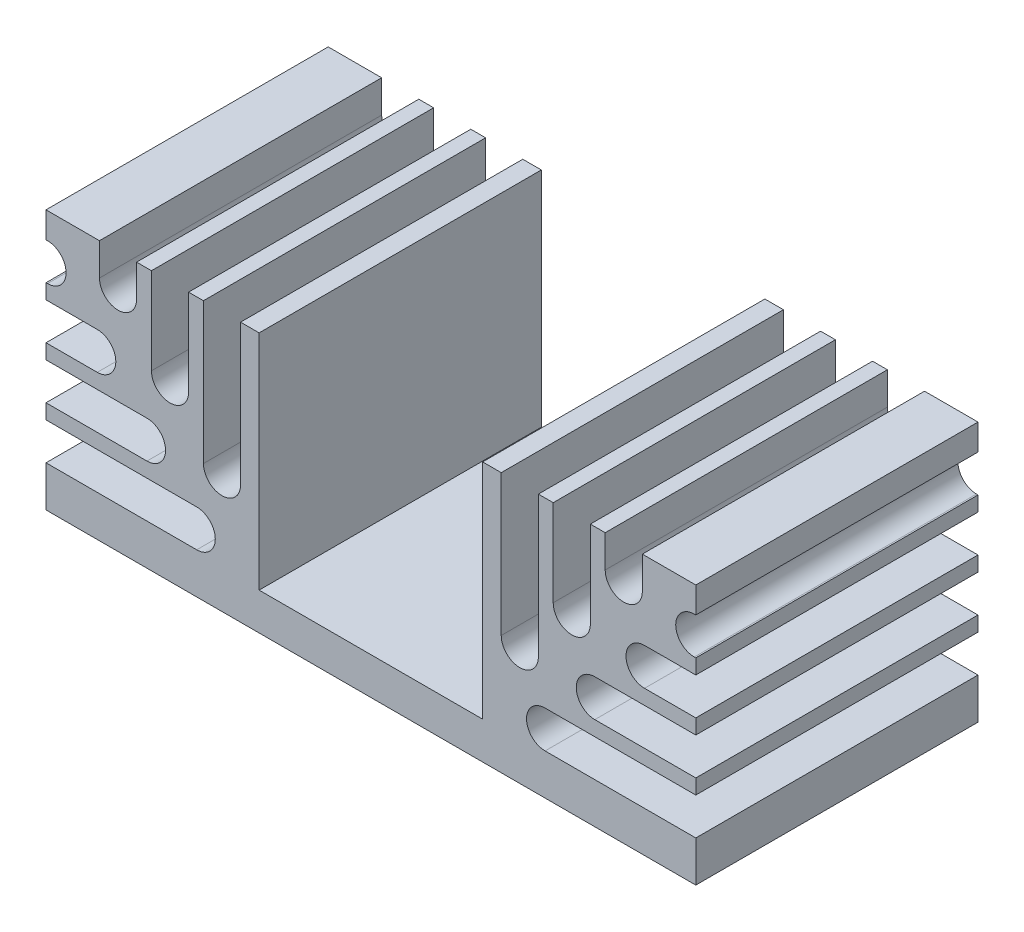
ISO-10303-21;
HEADER;
FILE_DESCRIPTION(('STEP AP214'),'2;1');
FILE_NAME('part.step','',(''),(''),'','','');
FILE_SCHEMA(('AUTOMOTIVE_DESIGN { 1 0 10303 214 1 1 1 1 }'));
ENDSEC;
DATA;
#1=APPLICATION_CONTEXT('core data for automotive mechanical design processes');
#2=APPLICATION_PROTOCOL_DEFINITION('international standard','automotive_design',2000,#1);
#3=PRODUCT_CONTEXT('',#1,'mechanical');
#4=PRODUCT('Part','Part','',(#3));
#5=PRODUCT_RELATED_PRODUCT_CATEGORY('part','',(#4));
#6=PRODUCT_DEFINITION_FORMATION('','',#4);
#7=PRODUCT_DEFINITION_CONTEXT('part definition',#1,'design');
#8=PRODUCT_DEFINITION('design','',#6,#7);
#9=PRODUCT_DEFINITION_SHAPE('','',#8);
#10=(LENGTH_UNIT() NAMED_UNIT(*) SI_UNIT(.MILLI.,.METRE.));
#11=(NAMED_UNIT(*) PLANE_ANGLE_UNIT() SI_UNIT($,.RADIAN.));
#12=(NAMED_UNIT(*) SI_UNIT($,.STERADIAN.) SOLID_ANGLE_UNIT());
#13=UNCERTAINTY_MEASURE_WITH_UNIT(LENGTH_MEASURE(1.E-05),#10,'distance_accuracy_value','');
#14=(GEOMETRIC_REPRESENTATION_CONTEXT(3) GLOBAL_UNCERTAINTY_ASSIGNED_CONTEXT((#13)) GLOBAL_UNIT_ASSIGNED_CONTEXT((#10,
#11,#12)) REPRESENTATION_CONTEXT('',''));
#15=CARTESIAN_POINT('',(0.,0.,0.));
#16=DIRECTION('',(0.,0.,1.));
#17=DIRECTION('',(1.,0.,0.));
#18=AXIS2_PLACEMENT_3D('',#15,#16,#17);
#19=CARTESIAN_POINT('',(0.,0.,38.));
#20=DIRECTION('',(0.,0.,1.));
#21=DIRECTION('',(1.,0.,0.));
#22=AXIS2_PLACEMENT_3D('',#19,#20,#21);
#23=PLANE('',#22);
#24=DIRECTION('',(0.,-1.,0.));
#25=VECTOR('',#24,1.);
#26=CARTESIAN_POINT('',(-37.3293656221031,14.1888786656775,38.));
#27=LINE('',#26,#25);
#28=CARTESIAN_POINT('',(-37.3293656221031,-1.3111213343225,38.));
#29=VERTEX_POINT('',#28);
#30=CARTESIAN_POINT('',(-37.3293656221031,-3.3111213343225,38.));
#31=VERTEX_POINT('',#30);
#32=EDGE_CURVE('E1145',#29,#31,#27,.T.);
#33=ORIENTED_EDGE('',*,*,#32,.T.);
#34=DIRECTION('',(1.,0.,0.));
#35=VECTOR('',#34,1.);
#36=CARTESIAN_POINT('',(-42.9467070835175,-3.3111213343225,38.));
#37=LINE('',#36,#35);
#38=CARTESIAN_POINT('',(-23.7316783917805,-3.3111213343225,38.));
#39=VERTEX_POINT('',#38);
#40=EDGE_CURVE('E720',#31,#39,#37,.T.);
#41=ORIENTED_EDGE('',*,*,#40,.T.);
#42=CARTESIAN_POINT('',(-23.7316783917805,-5.8111213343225,38.));
#43=DIRECTION('',(0.,0.,1.));
#44=DIRECTION('',(1.,0.,0.));
#45=AXIS2_PLACEMENT_3D('',#42,#43,#44);
#46=CIRCLE('',#45,2.5);
#47=CARTESIAN_POINT('',(-23.7316783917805,-8.3111213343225,38.));
#48=VERTEX_POINT('',#47);
#49=EDGE_CURVE('E723',#48,#39,#46,.T.);
#50=ORIENTED_EDGE('',*,*,#49,.F.);
#51=DIRECTION('',(1.,0.,0.));
#52=VECTOR('',#51,1.);
#53=CARTESIAN_POINT('',(-42.9467070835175,-8.3111213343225,38.));
#54=LINE('',#53,#52);
#55=CARTESIAN_POINT('',(-37.3293656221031,-8.3111213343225,38.));
#56=VERTEX_POINT('',#55);
#57=EDGE_CURVE('E726',#56,#48,#54,.T.);
#58=ORIENTED_EDGE('',*,*,#57,.F.);
#59=CARTESIAN_POINT('',(-37.3293656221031,-10.3111213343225,38.));
#60=VERTEX_POINT('',#59);
#61=EDGE_CURVE('E656',#56,#60,#27,.T.);
#62=ORIENTED_EDGE('',*,*,#61,.T.);
#63=DIRECTION('',(1.,0.,0.));
#64=VECTOR('',#63,1.);
#65=CARTESIAN_POINT('',(0.,-10.3111213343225,38.));
#66=LINE('',#65,#64);
#67=CARTESIAN_POINT('',(-17.0350117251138,-10.3111213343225,38.));
#68=VERTEX_POINT('',#67);
#69=EDGE_CURVE('E481',#60,#68,#66,.T.);
#70=ORIENTED_EDGE('',*,*,#69,.T.);
#71=CARTESIAN_POINT('',(-17.0350117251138,-12.8111213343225,38.));
#72=DIRECTION('',(0.,0.,1.));
#73=DIRECTION('',(1.,0.,0.));
#74=AXIS2_PLACEMENT_3D('',#71,#72,#73);
#75=CIRCLE('',#74,2.5);
#76=CARTESIAN_POINT('',(-17.0350117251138,-15.3111213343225,38.));
#77=VERTEX_POINT('',#76);
#78=EDGE_CURVE('E484',#77,#68,#75,.T.);
#79=ORIENTED_EDGE('',*,*,#78,.F.);
#80=DIRECTION('',(1.,0.,0.));
#81=VECTOR('',#80,1.);
#82=CARTESIAN_POINT('',(0.,-15.3111213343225,38.));
#83=LINE('',#82,#81);
#84=CARTESIAN_POINT('',(-37.3293656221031,-15.3111213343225,38.));
#85=VERTEX_POINT('',#84);
#86=EDGE_CURVE('E488',#85,#77,#83,.T.);
#87=ORIENTED_EDGE('',*,*,#86,.F.);
#88=CARTESIAN_POINT('',(-37.3293656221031,-20.8111213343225,38.));
#89=VERTEX_POINT('',#88);
#90=EDGE_CURVE('E687',#85,#89,#27,.T.);
#91=ORIENTED_EDGE('',*,*,#90,.T.);
#92=DIRECTION('',(1.,0.,0.));
#93=VECTOR('',#92,1.);
#94=CARTESIAN_POINT('',(-37.3293656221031,-20.8111213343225,38.));
#95=LINE('',#94,#93);
#96=CARTESIAN_POINT('',(50.1706343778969,-20.8111213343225,38.));
#97=VERTEX_POINT('',#96);
#98=EDGE_CURVE('E654',#89,#97,#95,.T.);
#99=ORIENTED_EDGE('',*,*,#98,.T.);
#100=DIRECTION('',(0.,1.,0.));
#101=VECTOR('',#100,1.);
#102=CARTESIAN_POINT('',(50.1706343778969,14.1888786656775,38.));
#103=LINE('',#102,#101);
#104=CARTESIAN_POINT('',(50.1706343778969,-15.3111213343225,38.));
#105=VERTEX_POINT('',#104);
#106=EDGE_CURVE('E659',#97,#105,#103,.T.);
#107=ORIENTED_EDGE('',*,*,#106,.T.);
#108=DIRECTION('',(-1.,0.,0.));
#109=VECTOR('',#108,1.);
#110=CARTESIAN_POINT('',(0.,-15.3111213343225,38.));
#111=LINE('',#110,#109);
#112=CARTESIAN_POINT('',(29.8762804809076,-15.3111213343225,38.));
#113=VERTEX_POINT('',#112);
#114=EDGE_CURVE('E746',#105,#113,#111,.T.);
#115=ORIENTED_EDGE('',*,*,#114,.T.);
#116=CARTESIAN_POINT('',(29.8762804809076,-12.8111213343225,38.));
#117=DIRECTION('',(0.,0.,1.));
#118=DIRECTION('',(1.,0.,0.));
#119=AXIS2_PLACEMENT_3D('',#116,#117,#118);
#120=CIRCLE('',#119,2.5);
#121=CARTESIAN_POINT('',(29.8762804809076,-10.3111213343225,38.));
#122=VERTEX_POINT('',#121);
#123=EDGE_CURVE('E750',#113,#122,#120,.F.);
#124=ORIENTED_EDGE('',*,*,#123,.T.);
#125=DIRECTION('',(-1.,0.,0.));
#126=VECTOR('',#125,1.);
#127=CARTESIAN_POINT('',(0.,-10.3111213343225,38.));
#128=LINE('',#127,#126);
#129=CARTESIAN_POINT('',(50.1706343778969,-10.3111213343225,38.));
#130=VERTEX_POINT('',#129);
#131=EDGE_CURVE('E743',#130,#122,#128,.T.);
#132=ORIENTED_EDGE('',*,*,#131,.F.);
#133=CARTESIAN_POINT('',(50.1706343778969,-8.31112133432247,38.));
#134=VERTEX_POINT('',#133);
#135=EDGE_CURVE('E663',#130,#134,#103,.T.);
#136=ORIENTED_EDGE('',*,*,#135,.T.);
#137=DIRECTION('',(-1.,0.,0.));
#138=VECTOR('',#137,1.);
#139=CARTESIAN_POINT('',(0.,-8.31112133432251,38.));
#140=LINE('',#139,#138);
#141=CARTESIAN_POINT('',(36.5729471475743,-8.31112133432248,38.));
#142=VERTEX_POINT('',#141);
#143=EDGE_CURVE('E771',#134,#142,#140,.T.);
#144=ORIENTED_EDGE('',*,*,#143,.T.);
#145=CARTESIAN_POINT('',(36.5729471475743,-5.81112133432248,38.));
#146=DIRECTION('',(0.,0.,1.));
#147=DIRECTION('',(1.,0.,0.));
#148=AXIS2_PLACEMENT_3D('',#145,#146,#147);
#149=CIRCLE('',#148,2.5);
#150=CARTESIAN_POINT('',(36.5729471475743,-3.31112133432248,38.));
#151=VERTEX_POINT('',#150);
#152=EDGE_CURVE('E775',#142,#151,#149,.F.);
#153=ORIENTED_EDGE('',*,*,#152,.T.);
#154=DIRECTION('',(-1.,0.,0.));
#155=VECTOR('',#154,1.);
#156=CARTESIAN_POINT('',(0.,-3.31112133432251,38.));
#157=LINE('',#156,#155);
#158=CARTESIAN_POINT('',(50.1706343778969,-3.31112133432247,38.));
#159=VERTEX_POINT('',#158);
#160=EDGE_CURVE('E768',#159,#151,#157,.T.);
#161=ORIENTED_EDGE('',*,*,#160,.F.);
#162=CARTESIAN_POINT('',(50.1706343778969,-1.31112133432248,38.));
#163=VERTEX_POINT('',#162);
#164=EDGE_CURVE('E955',#159,#163,#103,.T.);
#165=ORIENTED_EDGE('',*,*,#164,.T.);
#166=DIRECTION('',(-1.,0.,0.));
#167=VECTOR('',#166,1.);
#168=CARTESIAN_POINT('',(0.,-1.31112133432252,38.));
#169=LINE('',#168,#167);
#170=CARTESIAN_POINT('',(43.2696138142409,-1.31112133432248,38.));
#171=VERTEX_POINT('',#170);
#172=EDGE_CURVE('E796',#163,#171,#169,.T.);
#173=ORIENTED_EDGE('',*,*,#172,.T.);
#174=CARTESIAN_POINT('',(43.2696138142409,1.18887866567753,38.));
#175=DIRECTION('',(0.,0.,1.));
#176=DIRECTION('',(1.,0.,0.));
#177=AXIS2_PLACEMENT_3D('',#174,#175,#176);
#178=CIRCLE('',#177,2.5);
#179=CARTESIAN_POINT('',(43.2696138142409,3.68887866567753,38.));
#180=VERTEX_POINT('',#179);
#181=EDGE_CURVE('E800',#171,#180,#178,.F.);
#182=ORIENTED_EDGE('',*,*,#181,.T.);
#183=DIRECTION('',(-1.,0.,0.));
#184=VECTOR('',#183,1.);
#185=CARTESIAN_POINT('',(0.,3.6888786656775,38.));
#186=LINE('',#185,#184);
#187=CARTESIAN_POINT('',(50.1706343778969,3.68887866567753,38.));
#188=VERTEX_POINT('',#187);
#189=EDGE_CURVE('E793',#188,#180,#186,.T.);
#190=ORIENTED_EDGE('',*,*,#189,.F.);
#191=CARTESIAN_POINT('',(50.1706343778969,5.68887866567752,38.));
#192=VERTEX_POINT('',#191);
#193=EDGE_CURVE('E956',#188,#192,#103,.T.);
#194=ORIENTED_EDGE('',*,*,#193,.T.);
#195=DIRECTION('',(-1.,0.,0.));
#196=VECTOR('',#195,1.);
#197=CARTESIAN_POINT('',(0.,5.68887866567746,38.));
#198=LINE('',#197,#196);
#199=CARTESIAN_POINT('',(49.9662804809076,5.68887866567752,38.));
#200=VERTEX_POINT('',#199);
#201=EDGE_CURVE('E896',#192,#200,#198,.T.);
#202=ORIENTED_EDGE('',*,*,#201,.T.);
#203=CARTESIAN_POINT('',(49.9662804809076,8.18887866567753,38.));
#204=DIRECTION('',(0.,0.,1.));
#205=DIRECTION('',(1.,0.,0.));
#206=AXIS2_PLACEMENT_3D('',#203,#204,#205);
#207=CIRCLE('',#206,2.5);
#208=CARTESIAN_POINT('',(49.9662804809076,10.6888786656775,38.));
#209=VERTEX_POINT('',#208);
#210=EDGE_CURVE('E480',#200,#209,#207,.F.);
#211=ORIENTED_EDGE('',*,*,#210,.T.);
#212=DIRECTION('',(-1.,0.,0.));
#213=VECTOR('',#212,1.);
#214=CARTESIAN_POINT('',(0.,10.6888786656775,38.));
#215=LINE('',#214,#213);
#216=CARTESIAN_POINT('',(50.1706343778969,10.6888786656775,38.));
#217=VERTEX_POINT('',#216);
#218=EDGE_CURVE('E893',#217,#209,#215,.T.);
#219=ORIENTED_EDGE('',*,*,#218,.F.);
#220=CARTESIAN_POINT('',(50.1706343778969,14.1888786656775,38.));
#221=VERTEX_POINT('',#220);
#222=EDGE_CURVE('E658',#217,#221,#103,.T.);
#223=ORIENTED_EDGE('',*,*,#222,.T.);
#224=DIRECTION('',(-1.,0.,0.));
#225=VECTOR('',#224,1.);
#226=CARTESIAN_POINT('',(-37.3293656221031,14.1888786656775,38.));
#227=LINE('',#226,#225);
#228=CARTESIAN_POINT('',(42.9706343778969,14.1888786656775,38.));
#229=VERTEX_POINT('',#228);
#230=EDGE_CURVE('E664',#221,#229,#227,.T.);
#231=ORIENTED_EDGE('',*,*,#230,.T.);
#232=DIRECTION('',(0.,1.,0.));
#233=VECTOR('',#232,1.);
#234=CARTESIAN_POINT('',(42.9706343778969,0.,38.));
#235=LINE('',#234,#233);
#236=CARTESIAN_POINT('',(42.9706343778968,9.83589549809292,38.));
#237=VERTEX_POINT('',#236);
#238=EDGE_CURVE('E872',#237,#229,#235,.T.);
#239=ORIENTED_EDGE('',*,*,#238,.F.);
#240=CARTESIAN_POINT('',(40.4706343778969,9.83589549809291,38.));
#241=DIRECTION('',(0.,0.,1.));
#242=DIRECTION('',(1.,0.,0.));
#243=AXIS2_PLACEMENT_3D('',#240,#241,#242);
#244=CIRCLE('',#243,2.5);
#245=CARTESIAN_POINT('',(37.9706343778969,9.83589549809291,38.));
#246=VERTEX_POINT('',#245);
#247=EDGE_CURVE('E875',#237,#246,#244,.F.);
#248=ORIENTED_EDGE('',*,*,#247,.T.);
#249=DIRECTION('',(0.,1.,0.));
#250=VECTOR('',#249,1.);
#251=CARTESIAN_POINT('',(37.9706343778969,0.,38.));
#252=LINE('',#251,#250);
#253=CARTESIAN_POINT('',(37.9706343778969,14.1888786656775,38.));
#254=VERTEX_POINT('',#253);
#255=EDGE_CURVE('E869',#246,#254,#252,.T.);
#256=ORIENTED_EDGE('',*,*,#255,.T.);
#257=CARTESIAN_POINT('',(35.9706343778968,14.1888786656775,38.));
#258=VERTEX_POINT('',#257);
#259=EDGE_CURVE('E668',#254,#258,#227,.T.);
#260=ORIENTED_EDGE('',*,*,#259,.T.);
#261=DIRECTION('',(0.,-1.,0.));
#262=VECTOR('',#261,1.);
#263=CARTESIAN_POINT('',(35.9706343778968,0.,38.));
#264=LINE('',#263,#262);
#265=CARTESIAN_POINT('',(35.9706343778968,2.5188223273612,38.));
#266=VERTEX_POINT('',#265);
#267=EDGE_CURVE('E846',#258,#266,#264,.T.);
#268=ORIENTED_EDGE('',*,*,#267,.T.);
#269=CARTESIAN_POINT('',(33.4706343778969,2.5188223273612,38.));
#270=DIRECTION('',(0.,0.,1.));
#271=DIRECTION('',(1.,0.,0.));
#272=AXIS2_PLACEMENT_3D('',#269,#270,#271);
#273=CIRCLE('',#272,2.49999999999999);
#274=CARTESIAN_POINT('',(30.9706343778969,2.5188223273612,38.));
#275=VERTEX_POINT('',#274);
#276=EDGE_CURVE('E850',#266,#275,#273,.F.);
#277=ORIENTED_EDGE('',*,*,#276,.T.);
#278=DIRECTION('',(0.,-1.,0.));
#279=VECTOR('',#278,1.);
#280=CARTESIAN_POINT('',(30.9706343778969,0.,38.));
#281=LINE('',#280,#279);
#282=CARTESIAN_POINT('',(30.9706343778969,14.1888786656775,38.));
#283=VERTEX_POINT('',#282);
#284=EDGE_CURVE('E843',#283,#275,#281,.T.);
#285=ORIENTED_EDGE('',*,*,#284,.F.);
#286=CARTESIAN_POINT('',(28.9706343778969,14.1888786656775,38.));
#287=VERTEX_POINT('',#286);
#288=EDGE_CURVE('E985',#283,#287,#227,.T.);
#289=ORIENTED_EDGE('',*,*,#288,.T.);
#290=DIRECTION('',(0.,-1.,0.));
#291=VECTOR('',#290,1.);
#292=CARTESIAN_POINT('',(28.9706343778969,0.,38.));
#293=LINE('',#292,#291);
#294=CARTESIAN_POINT('',(28.9706343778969,-4.79825084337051,38.));
#295=VERTEX_POINT('',#294);
#296=EDGE_CURVE('E821',#287,#295,#293,.T.);
#297=ORIENTED_EDGE('',*,*,#296,.T.);
#298=CARTESIAN_POINT('',(26.4706343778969,-4.79825084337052,38.));
#299=DIRECTION('',(0.,0.,1.));
#300=DIRECTION('',(1.,0.,0.));
#301=AXIS2_PLACEMENT_3D('',#298,#299,#300);
#302=CIRCLE('',#301,2.5);
#303=CARTESIAN_POINT('',(23.9706343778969,-4.79825084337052,38.));
#304=VERTEX_POINT('',#303);
#305=EDGE_CURVE('E825',#295,#304,#302,.F.);
#306=ORIENTED_EDGE('',*,*,#305,.T.);
#307=DIRECTION('',(0.,-1.,0.));
#308=VECTOR('',#307,1.);
#309=CARTESIAN_POINT('',(23.9706343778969,0.,38.));
#310=LINE('',#309,#308);
#311=CARTESIAN_POINT('',(23.9706343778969,14.1888786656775,38.));
#312=VERTEX_POINT('',#311);
#313=EDGE_CURVE('E818',#312,#304,#310,.T.);
#314=ORIENTED_EDGE('',*,*,#313,.F.);
#315=CARTESIAN_POINT('',(21.4706343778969,14.1888786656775,38.));
#316=VERTEX_POINT('',#315);
#317=EDGE_CURVE('E669',#312,#316,#227,.T.);
#318=ORIENTED_EDGE('',*,*,#317,.T.);
#319=DIRECTION('',(0.,1.,0.));
#320=VECTOR('',#319,1.);
#321=CARTESIAN_POINT('',(21.4706343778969,0.,38.));
#322=LINE('',#321,#320);
#323=CARTESIAN_POINT('',(21.4706343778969,-15.8111213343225,38.));
#324=VERTEX_POINT('',#323);
#325=EDGE_CURVE('E582',#324,#316,#322,.T.);
#326=ORIENTED_EDGE('',*,*,#325,.F.);
#327=DIRECTION('',(1.,0.,0.));
#328=VECTOR('',#327,1.);
#329=CARTESIAN_POINT('',(0.,-15.8111213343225,38.));
#330=LINE('',#329,#328);
#331=CARTESIAN_POINT('',(-8.62936562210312,-15.8111213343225,38.));
#332=VERTEX_POINT('',#331);
#333=EDGE_CURVE('E586',#332,#324,#330,.T.);
#334=ORIENTED_EDGE('',*,*,#333,.F.);
#335=DIRECTION('',(0.,-1.,0.));
#336=VECTOR('',#335,1.);
#337=CARTESIAN_POINT('',(-8.62936562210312,0.,38.));
#338=LINE('',#337,#336);
#339=CARTESIAN_POINT('',(-8.62936562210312,14.1888786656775,38.));
#340=VERTEX_POINT('',#339);
#341=EDGE_CURVE('E579',#340,#332,#338,.T.);
#342=ORIENTED_EDGE('',*,*,#341,.F.);
#343=CARTESIAN_POINT('',(-11.1293656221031,14.1888786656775,38.));
#344=VERTEX_POINT('',#343);
#345=EDGE_CURVE('E987',#340,#344,#227,.T.);
#346=ORIENTED_EDGE('',*,*,#345,.T.);
#347=DIRECTION('',(0.,-1.,0.));
#348=VECTOR('',#347,1.);
#349=CARTESIAN_POINT('',(-11.1293656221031,0.,38.));
#350=LINE('',#349,#348);
#351=CARTESIAN_POINT('',(-11.1293656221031,-4.79825084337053,38.));
#352=VERTEX_POINT('',#351);
#353=EDGE_CURVE('E606',#344,#352,#350,.T.);
#354=ORIENTED_EDGE('',*,*,#353,.T.);
#355=CARTESIAN_POINT('',(-13.6293656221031,-4.79825084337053,38.));
#356=DIRECTION('',(0.,0.,1.));
#357=DIRECTION('',(1.,0.,0.));
#358=AXIS2_PLACEMENT_3D('',#355,#356,#357);
#359=CIRCLE('',#358,2.5);
#360=CARTESIAN_POINT('',(-16.1293656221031,-4.79825084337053,38.));
#361=VERTEX_POINT('',#360);
#362=EDGE_CURVE('E609',#361,#352,#359,.T.);
#363=ORIENTED_EDGE('',*,*,#362,.F.);
#364=DIRECTION('',(0.,-1.,0.));
#365=VECTOR('',#364,1.);
#366=CARTESIAN_POINT('',(-16.1293656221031,0.,38.));
#367=LINE('',#366,#365);
#368=CARTESIAN_POINT('',(-16.1293656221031,14.1888786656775,38.));
#369=VERTEX_POINT('',#368);
#370=EDGE_CURVE('E613',#369,#361,#367,.T.);
#371=ORIENTED_EDGE('',*,*,#370,.F.);
#372=CARTESIAN_POINT('',(-18.1293656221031,14.1888786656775,38.));
#373=VERTEX_POINT('',#372);
#374=EDGE_CURVE('E991',#369,#373,#227,.T.);
#375=ORIENTED_EDGE('',*,*,#374,.T.);
#376=DIRECTION('',(0.,-1.,0.));
#377=VECTOR('',#376,1.);
#378=CARTESIAN_POINT('',(-18.1293656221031,0.,38.));
#379=LINE('',#378,#377);
#380=CARTESIAN_POINT('',(-18.1293656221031,2.51882232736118,38.));
#381=VERTEX_POINT('',#380);
#382=EDGE_CURVE('E628',#373,#381,#379,.T.);
#383=ORIENTED_EDGE('',*,*,#382,.T.);
#384=CARTESIAN_POINT('',(-20.6293656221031,2.51882232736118,38.));
#385=DIRECTION('',(0.,0.,1.));
#386=DIRECTION('',(1.,0.,0.));
#387=AXIS2_PLACEMENT_3D('',#384,#385,#386);
#388=CIRCLE('',#387,2.49999999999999);
#389=CARTESIAN_POINT('',(-23.1293656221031,2.51882232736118,38.));
#390=VERTEX_POINT('',#389);
#391=EDGE_CURVE('E637',#390,#381,#388,.T.);
#392=ORIENTED_EDGE('',*,*,#391,.F.);
#393=DIRECTION('',(0.,-1.,0.));
#394=VECTOR('',#393,1.);
#395=CARTESIAN_POINT('',(-23.1293656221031,0.,38.));
#396=LINE('',#395,#394);
#397=CARTESIAN_POINT('',(-23.1293656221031,14.1888786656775,38.));
#398=VERTEX_POINT('',#397);
#399=EDGE_CURVE('E616',#398,#390,#396,.T.);
#400=ORIENTED_EDGE('',*,*,#399,.F.);
#401=CARTESIAN_POINT('',(-25.1293656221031,14.1888786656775,38.));
#402=VERTEX_POINT('',#401);
#403=EDGE_CURVE('E670',#398,#402,#227,.T.);
#404=ORIENTED_EDGE('',*,*,#403,.T.);
#405=DIRECTION('',(0.,1.,0.));
#406=VECTOR('',#405,1.);
#407=CARTESIAN_POINT('',(-25.1293656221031,0.,38.));
#408=LINE('',#407,#406);
#409=CARTESIAN_POINT('',(-25.1293656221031,9.83589549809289,38.));
#410=VERTEX_POINT('',#409);
#411=EDGE_CURVE('E554',#410,#402,#408,.T.);
#412=ORIENTED_EDGE('',*,*,#411,.F.);
#413=CARTESIAN_POINT('',(-27.6293656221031,9.83589549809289,38.));
#414=DIRECTION('',(0.,0.,1.));
#415=DIRECTION('',(1.,0.,0.));
#416=AXIS2_PLACEMENT_3D('',#413,#414,#415);
#417=CIRCLE('',#416,2.5);
#418=CARTESIAN_POINT('',(-30.1293656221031,9.83589549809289,38.));
#419=VERTEX_POINT('',#418);
#420=EDGE_CURVE('E556',#419,#410,#417,.T.);
#421=ORIENTED_EDGE('',*,*,#420,.F.);
#422=DIRECTION('',(0.,1.,0.));
#423=VECTOR('',#422,1.);
#424=CARTESIAN_POINT('',(-30.1293656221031,0.,38.));
#425=LINE('',#424,#423);
#426=CARTESIAN_POINT('',(-30.1293656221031,14.1888786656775,38.));
#427=VERTEX_POINT('',#426);
#428=EDGE_CURVE('E560',#419,#427,#425,.T.);
#429=ORIENTED_EDGE('',*,*,#428,.T.);
#430=CARTESIAN_POINT('',(-37.3293656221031,14.1888786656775,38.));
#431=VERTEX_POINT('',#430);
#432=EDGE_CURVE('E662',#427,#431,#227,.T.);
#433=ORIENTED_EDGE('',*,*,#432,.T.);
#434=CARTESIAN_POINT('',(-37.3293656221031,10.6888786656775,38.));
#435=VERTEX_POINT('',#434);
#436=EDGE_CURVE('E651',#431,#435,#27,.T.);
#437=ORIENTED_EDGE('',*,*,#436,.T.);
#438=DIRECTION('',(1.,0.,0.));
#439=VECTOR('',#438,1.);
#440=CARTESIAN_POINT('',(0.,10.6888786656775,38.));
#441=LINE('',#440,#439);
#442=CARTESIAN_POINT('',(-37.1250117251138,10.6888786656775,38.));
#443=VERTEX_POINT('',#442);
#444=EDGE_CURVE('E528',#435,#443,#441,.T.);
#445=ORIENTED_EDGE('',*,*,#444,.T.);
#446=CARTESIAN_POINT('',(-37.1250117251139,8.1888786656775,38.));
#447=DIRECTION('',(0.,0.,1.));
#448=DIRECTION('',(1.,0.,0.));
#449=AXIS2_PLACEMENT_3D('',#446,#447,#448);
#450=CIRCLE('',#449,2.5);
#451=CARTESIAN_POINT('',(-37.1250117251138,5.6888786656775,38.));
#452=VERTEX_POINT('',#451);
#453=EDGE_CURVE('E531',#452,#443,#450,.T.);
#454=ORIENTED_EDGE('',*,*,#453,.F.);
#455=DIRECTION('',(1.,0.,0.));
#456=VECTOR('',#455,1.);
#457=CARTESIAN_POINT('',(0.,5.68887866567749,38.));
#458=LINE('',#457,#456);
#459=CARTESIAN_POINT('',(-37.3293656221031,5.6888786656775,38.));
#460=VERTEX_POINT('',#459);
#461=EDGE_CURVE('E535',#460,#452,#458,.T.);
#462=ORIENTED_EDGE('',*,*,#461,.F.);
#463=CARTESIAN_POINT('',(-37.3293656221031,3.6888786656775,38.));
#464=VERTEX_POINT('',#463);
#465=EDGE_CURVE('E655',#460,#464,#27,.T.);
#466=ORIENTED_EDGE('',*,*,#465,.T.);
#467=DIRECTION('',(1.,0.,0.));
#468=VECTOR('',#467,1.);
#469=CARTESIAN_POINT('',(0.,3.6888786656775,38.));
#470=LINE('',#469,#468);
#471=CARTESIAN_POINT('',(-30.4283450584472,3.6888786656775,38.));
#472=VERTEX_POINT('',#471);
#473=EDGE_CURVE('E502',#464,#472,#470,.T.);
#474=ORIENTED_EDGE('',*,*,#473,.T.);
#475=CARTESIAN_POINT('',(-30.4283450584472,1.1888786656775,38.));
#476=DIRECTION('',(0.,0.,1.));
#477=DIRECTION('',(1.,0.,0.));
#478=AXIS2_PLACEMENT_3D('',#475,#476,#477);
#479=CIRCLE('',#478,2.5);
#480=CARTESIAN_POINT('',(-30.4283450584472,-1.3111213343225,38.));
#481=VERTEX_POINT('',#480);
#482=EDGE_CURVE('E505',#481,#472,#479,.T.);
#483=ORIENTED_EDGE('',*,*,#482,.F.);
#484=DIRECTION('',(1.,0.,0.));
#485=VECTOR('',#484,1.);
#486=CARTESIAN_POINT('',(0.,-1.3111213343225,38.));
#487=LINE('',#486,#485);
#488=EDGE_CURVE('E509',#29,#481,#487,.T.);
#489=ORIENTED_EDGE('',*,*,#488,.F.);
#490=EDGE_LOOP('',(#33,#41,#50,#58,#62,#70,#79,#87,#91,#99,#107,#115,#124,#132,#136,#144,#153,
#161,#165,#173,#182,#190,#194,#202,#211,#219,#223,#231,#239,#248,#256,#260,#268,#277,#285,#289,
#297,#306,#314,#318,#326,#334,#342,#346,#354,#363,#371,#375,#383,#392,#400,#404,#412,#421,#429,
#433,#437,#445,#454,#462,#466,#474,#483,#489));
#491=FACE_BOUND('',#490,.T.);
#492=ADVANCED_FACE('F40',(#491),#23,.T.);
#493=CARTESIAN_POINT('',(0.,0.,0.));
#494=DIRECTION('',(0.,0.,1.));
#495=DIRECTION('',(1.,0.,0.));
#496=AXIS2_PLACEMENT_3D('',#493,#494,#495);
#497=PLANE('',#496);
#498=DIRECTION('',(1.,0.,0.));
#499=VECTOR('',#498,1.);
#500=CARTESIAN_POINT('',(-42.9467070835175,-3.3111213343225,0.));
#501=LINE('',#500,#499);
#502=CARTESIAN_POINT('',(-37.3293656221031,-3.3111213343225,0.));
#503=VERTEX_POINT('',#502);
#504=CARTESIAN_POINT('',(-23.7316783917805,-3.3111213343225,0.));
#505=VERTEX_POINT('',#504);
#506=EDGE_CURVE('E718',#503,#505,#501,.T.);
#507=ORIENTED_EDGE('',*,*,#506,.F.);
#508=DIRECTION('',(0.,-1.,0.));
#509=VECTOR('',#508,1.);
#510=CARTESIAN_POINT('',(-37.3293656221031,14.1888786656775,0.));
#511=LINE('',#510,#509);
#512=CARTESIAN_POINT('',(-37.3293656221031,-1.3111213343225,0.));
#513=VERTEX_POINT('',#512);
#514=EDGE_CURVE('E1121',#513,#503,#511,.T.);
#515=ORIENTED_EDGE('',*,*,#514,.F.);
#516=DIRECTION('',(1.,0.,0.));
#517=VECTOR('',#516,1.);
#518=CARTESIAN_POINT('',(0.,-1.3111213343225,0.));
#519=LINE('',#518,#517);
#520=CARTESIAN_POINT('',(-30.4283450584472,-1.3111213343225,0.));
#521=VERTEX_POINT('',#520);
#522=EDGE_CURVE('E506',#513,#521,#519,.T.);
#523=ORIENTED_EDGE('',*,*,#522,.T.);
#524=CARTESIAN_POINT('',(-30.4283450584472,1.1888786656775,0.));
#525=DIRECTION('',(0.,0.,1.));
#526=DIRECTION('',(1.,0.,0.));
#527=AXIS2_PLACEMENT_3D('',#524,#525,#526);
#528=CIRCLE('',#527,2.5);
#529=CARTESIAN_POINT('',(-30.4283450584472,3.6888786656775,0.));
#530=VERTEX_POINT('',#529);
#531=EDGE_CURVE('E514',#521,#530,#528,.T.);
#532=ORIENTED_EDGE('',*,*,#531,.T.);
#533=DIRECTION('',(1.,0.,0.));
#534=VECTOR('',#533,1.);
#535=CARTESIAN_POINT('',(0.,3.6888786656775,0.));
#536=LINE('',#535,#534);
#537=CARTESIAN_POINT('',(-37.3293656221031,3.6888786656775,0.));
#538=VERTEX_POINT('',#537);
#539=EDGE_CURVE('E495',#538,#530,#536,.T.);
#540=ORIENTED_EDGE('',*,*,#539,.F.);
#541=CARTESIAN_POINT('',(-37.3293656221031,5.6888786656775,0.));
#542=VERTEX_POINT('',#541);
#543=EDGE_CURVE('E675',#542,#538,#511,.T.);
#544=ORIENTED_EDGE('',*,*,#543,.F.);
#545=DIRECTION('',(1.,0.,0.));
#546=VECTOR('',#545,1.);
#547=CARTESIAN_POINT('',(0.,5.68887866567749,0.));
#548=LINE('',#547,#546);
#549=CARTESIAN_POINT('',(-37.1250117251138,5.6888786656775,0.));
#550=VERTEX_POINT('',#549);
#551=EDGE_CURVE('E532',#542,#550,#548,.T.);
#552=ORIENTED_EDGE('',*,*,#551,.T.);
#553=CARTESIAN_POINT('',(-37.1250117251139,8.1888786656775,0.));
#554=DIRECTION('',(0.,0.,1.));
#555=DIRECTION('',(1.,0.,0.));
#556=AXIS2_PLACEMENT_3D('',#553,#554,#555);
#557=CIRCLE('',#556,2.5);
#558=CARTESIAN_POINT('',(-37.1250117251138,10.6888786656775,0.));
#559=VERTEX_POINT('',#558);
#560=EDGE_CURVE('E540',#550,#559,#557,.T.);
#561=ORIENTED_EDGE('',*,*,#560,.T.);
#562=DIRECTION('',(1.,0.,0.));
#563=VECTOR('',#562,1.);
#564=CARTESIAN_POINT('',(0.,10.6888786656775,0.));
#565=LINE('',#564,#563);
#566=CARTESIAN_POINT('',(-37.3293656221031,10.6888786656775,0.));
#567=VERTEX_POINT('',#566);
#568=EDGE_CURVE('E521',#567,#559,#565,.T.);
#569=ORIENTED_EDGE('',*,*,#568,.F.);
#570=CARTESIAN_POINT('',(-37.3293656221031,14.1888786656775,0.));
#571=VERTEX_POINT('',#570);
#572=EDGE_CURVE('E671',#571,#567,#511,.T.);
#573=ORIENTED_EDGE('',*,*,#572,.F.);
#574=DIRECTION('',(-1.,0.,0.));
#575=VECTOR('',#574,1.);
#576=CARTESIAN_POINT('',(-37.3293656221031,14.1888786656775,0.));
#577=LINE('',#576,#575);
#578=CARTESIAN_POINT('',(-30.1293656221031,14.1888786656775,0.));
#579=VERTEX_POINT('',#578);
#580=EDGE_CURVE('E682',#579,#571,#577,.T.);
#581=ORIENTED_EDGE('',*,*,#580,.F.);
#582=DIRECTION('',(0.,1.,0.));
#583=VECTOR('',#582,1.);
#584=CARTESIAN_POINT('',(-30.1293656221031,0.,0.));
#585=LINE('',#584,#583);
#586=CARTESIAN_POINT('',(-30.1293656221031,9.83589549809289,0.));
#587=VERTEX_POINT('',#586);
#588=EDGE_CURVE('E557',#587,#579,#585,.T.);
#589=ORIENTED_EDGE('',*,*,#588,.F.);
#590=CARTESIAN_POINT('',(-27.6293656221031,9.83589549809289,0.));
#591=DIRECTION('',(0.,0.,1.));
#592=DIRECTION('',(1.,0.,0.));
#593=AXIS2_PLACEMENT_3D('',#590,#591,#592);
#594=CIRCLE('',#593,2.5);
#595=CARTESIAN_POINT('',(-25.1293656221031,9.83589549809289,0.));
#596=VERTEX_POINT('',#595);
#597=EDGE_CURVE('E566',#587,#596,#594,.T.);
#598=ORIENTED_EDGE('',*,*,#597,.T.);
#599=DIRECTION('',(0.,1.,0.));
#600=VECTOR('',#599,1.);
#601=CARTESIAN_POINT('',(-25.1293656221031,0.,0.));
#602=LINE('',#601,#600);
#603=CARTESIAN_POINT('',(-25.1293656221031,14.1888786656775,0.));
#604=VERTEX_POINT('',#603);
#605=EDGE_CURVE('E547',#596,#604,#602,.T.);
#606=ORIENTED_EDGE('',*,*,#605,.T.);
#607=CARTESIAN_POINT('',(-23.1293656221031,14.1888786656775,0.));
#608=VERTEX_POINT('',#607);
#609=EDGE_CURVE('E690',#608,#604,#577,.T.);
#610=ORIENTED_EDGE('',*,*,#609,.F.);
#611=DIRECTION('',(0.,-1.,0.));
#612=VECTOR('',#611,1.);
#613=CARTESIAN_POINT('',(-23.1293656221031,0.,0.));
#614=LINE('',#613,#612);
#615=CARTESIAN_POINT('',(-23.1293656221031,2.51882232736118,0.));
#616=VERTEX_POINT('',#615);
#617=EDGE_CURVE('E624',#608,#616,#614,.T.);
#618=ORIENTED_EDGE('',*,*,#617,.T.);
#619=CARTESIAN_POINT('',(-20.6293656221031,2.51882232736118,0.));
#620=DIRECTION('',(0.,0.,1.));
#621=DIRECTION('',(1.,0.,0.));
#622=AXIS2_PLACEMENT_3D('',#619,#620,#621);
#623=CIRCLE('',#622,2.49999999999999);
#624=CARTESIAN_POINT('',(-18.1293656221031,2.51882232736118,0.));
#625=VERTEX_POINT('',#624);
#626=EDGE_CURVE('E627',#616,#625,#623,.T.);
#627=ORIENTED_EDGE('',*,*,#626,.T.);
#628=DIRECTION('',(0.,-1.,0.));
#629=VECTOR('',#628,1.);
#630=CARTESIAN_POINT('',(-18.1293656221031,0.,0.));
#631=LINE('',#630,#629);
#632=CARTESIAN_POINT('',(-18.1293656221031,14.1888786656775,0.));
#633=VERTEX_POINT('',#632);
#634=EDGE_CURVE('E631',#633,#625,#631,.T.);
#635=ORIENTED_EDGE('',*,*,#634,.F.);
#636=CARTESIAN_POINT('',(-16.1293656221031,14.1888786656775,0.));
#637=VERTEX_POINT('',#636);
#638=EDGE_CURVE('E1008',#637,#633,#577,.T.);
#639=ORIENTED_EDGE('',*,*,#638,.F.);
#640=DIRECTION('',(0.,-1.,0.));
#641=VECTOR('',#640,1.);
#642=CARTESIAN_POINT('',(-16.1293656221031,0.,0.));
#643=LINE('',#642,#641);
#644=CARTESIAN_POINT('',(-16.1293656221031,-4.79825084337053,0.));
#645=VERTEX_POINT('',#644);
#646=EDGE_CURVE('E610',#637,#645,#643,.T.);
#647=ORIENTED_EDGE('',*,*,#646,.T.);
#648=CARTESIAN_POINT('',(-13.6293656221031,-4.79825084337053,0.));
#649=DIRECTION('',(0.,0.,1.));
#650=DIRECTION('',(1.,0.,0.));
#651=AXIS2_PLACEMENT_3D('',#648,#649,#650);
#652=CIRCLE('',#651,2.5);
#653=CARTESIAN_POINT('',(-11.1293656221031,-4.79825084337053,0.));
#654=VERTEX_POINT('',#653);
#655=EDGE_CURVE('E619',#645,#654,#652,.T.);
#656=ORIENTED_EDGE('',*,*,#655,.T.);
#657=DIRECTION('',(0.,-1.,0.));
#658=VECTOR('',#657,1.);
#659=CARTESIAN_POINT('',(-11.1293656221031,0.,0.));
#660=LINE('',#659,#658);
#661=CARTESIAN_POINT('',(-11.1293656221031,14.1888786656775,0.));
#662=VERTEX_POINT('',#661);
#663=EDGE_CURVE('E599',#662,#654,#660,.T.);
#664=ORIENTED_EDGE('',*,*,#663,.F.);
#665=CARTESIAN_POINT('',(-8.62936562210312,14.1888786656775,0.));
#666=VERTEX_POINT('',#665);
#667=EDGE_CURVE('E1009',#666,#662,#577,.T.);
#668=ORIENTED_EDGE('',*,*,#667,.F.);
#669=DIRECTION('',(0.,-1.,0.));
#670=VECTOR('',#669,1.);
#671=CARTESIAN_POINT('',(-8.62936562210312,0.,0.));
#672=LINE('',#671,#670);
#673=CARTESIAN_POINT('',(-8.62936562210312,-15.8111213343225,0.));
#674=VERTEX_POINT('',#673);
#675=EDGE_CURVE('E572',#666,#674,#672,.T.);
#676=ORIENTED_EDGE('',*,*,#675,.T.);
#677=DIRECTION('',(1.,0.,0.));
#678=VECTOR('',#677,1.);
#679=CARTESIAN_POINT('',(0.,-15.8111213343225,0.));
#680=LINE('',#679,#678);
#681=CARTESIAN_POINT('',(21.4706343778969,-15.8111213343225,0.));
#682=VERTEX_POINT('',#681);
#683=EDGE_CURVE('E583',#674,#682,#680,.T.);
#684=ORIENTED_EDGE('',*,*,#683,.T.);
#685=DIRECTION('',(0.,1.,0.));
#686=VECTOR('',#685,1.);
#687=CARTESIAN_POINT('',(21.4706343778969,0.,0.));
#688=LINE('',#687,#686);
#689=CARTESIAN_POINT('',(21.4706343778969,14.1888786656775,0.));
#690=VERTEX_POINT('',#689);
#691=EDGE_CURVE('E592',#682,#690,#688,.T.);
#692=ORIENTED_EDGE('',*,*,#691,.T.);
#693=CARTESIAN_POINT('',(23.9706343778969,14.1888786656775,0.));
#694=VERTEX_POINT('',#693);
#695=EDGE_CURVE('E689',#694,#690,#577,.T.);
#696=ORIENTED_EDGE('',*,*,#695,.F.);
#697=DIRECTION('',(0.,-1.,0.));
#698=VECTOR('',#697,1.);
#699=CARTESIAN_POINT('',(23.9706343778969,0.,0.));
#700=LINE('',#699,#698);
#701=CARTESIAN_POINT('',(23.9706343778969,-4.79825084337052,0.));
#702=VERTEX_POINT('',#701);
#703=EDGE_CURVE('E811',#694,#702,#700,.T.);
#704=ORIENTED_EDGE('',*,*,#703,.T.);
#705=CARTESIAN_POINT('',(26.4706343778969,-4.79825084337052,0.));
#706=DIRECTION('',(0.,0.,1.));
#707=DIRECTION('',(1.,0.,0.));
#708=AXIS2_PLACEMENT_3D('',#705,#706,#707);
#709=CIRCLE('',#708,2.5);
#710=CARTESIAN_POINT('',(28.9706343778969,-4.79825084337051,0.));
#711=VERTEX_POINT('',#710);
#712=EDGE_CURVE('E822',#711,#702,#709,.F.);
#713=ORIENTED_EDGE('',*,*,#712,.F.);
#714=DIRECTION('',(0.,-1.,0.));
#715=VECTOR('',#714,1.);
#716=CARTESIAN_POINT('',(28.9706343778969,0.,0.));
#717=LINE('',#716,#715);
#718=CARTESIAN_POINT('',(28.9706343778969,14.1888786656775,0.));
#719=VERTEX_POINT('',#718);
#720=EDGE_CURVE('E831',#719,#711,#717,.T.);
#721=ORIENTED_EDGE('',*,*,#720,.F.);
#722=CARTESIAN_POINT('',(30.9706343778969,14.1888786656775,0.));
#723=VERTEX_POINT('',#722);
#724=EDGE_CURVE('E1017',#723,#719,#577,.T.);
#725=ORIENTED_EDGE('',*,*,#724,.F.);
#726=DIRECTION('',(0.,-1.,0.));
#727=VECTOR('',#726,1.);
#728=CARTESIAN_POINT('',(30.9706343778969,0.,0.));
#729=LINE('',#728,#727);
#730=CARTESIAN_POINT('',(30.9706343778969,2.5188223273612,0.));
#731=VERTEX_POINT('',#730);
#732=EDGE_CURVE('E836',#723,#731,#729,.T.);
#733=ORIENTED_EDGE('',*,*,#732,.T.);
#734=CARTESIAN_POINT('',(33.4706343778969,2.5188223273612,0.));
#735=DIRECTION('',(0.,0.,1.));
#736=DIRECTION('',(1.,0.,0.));
#737=AXIS2_PLACEMENT_3D('',#734,#735,#736);
#738=CIRCLE('',#737,2.49999999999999);
#739=CARTESIAN_POINT('',(35.9706343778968,2.5188223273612,0.));
#740=VERTEX_POINT('',#739);
#741=EDGE_CURVE('E847',#740,#731,#738,.F.);
#742=ORIENTED_EDGE('',*,*,#741,.F.);
#743=DIRECTION('',(0.,-1.,0.));
#744=VECTOR('',#743,1.);
#745=CARTESIAN_POINT('',(35.9706343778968,0.,0.));
#746=LINE('',#745,#744);
#747=CARTESIAN_POINT('',(35.9706343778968,14.1888786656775,0.));
#748=VERTEX_POINT('',#747);
#749=EDGE_CURVE('E856',#748,#740,#746,.T.);
#750=ORIENTED_EDGE('',*,*,#749,.F.);
#751=CARTESIAN_POINT('',(37.9706343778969,14.1888786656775,0.));
#752=VERTEX_POINT('',#751);
#753=EDGE_CURVE('E688',#752,#748,#577,.T.);
#754=ORIENTED_EDGE('',*,*,#753,.F.);
#755=DIRECTION('',(0.,1.,0.));
#756=VECTOR('',#755,1.);
#757=CARTESIAN_POINT('',(37.9706343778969,0.,0.));
#758=LINE('',#757,#756);
#759=CARTESIAN_POINT('',(37.9706343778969,9.83589549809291,0.));
#760=VERTEX_POINT('',#759);
#761=EDGE_CURVE('E861',#760,#752,#758,.T.);
#762=ORIENTED_EDGE('',*,*,#761,.F.);
#763=CARTESIAN_POINT('',(40.4706343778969,9.83589549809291,0.));
#764=DIRECTION('',(0.,0.,1.));
#765=DIRECTION('',(1.,0.,0.));
#766=AXIS2_PLACEMENT_3D('',#763,#764,#765);
#767=CIRCLE('',#766,2.5);
#768=CARTESIAN_POINT('',(42.9706343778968,9.83589549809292,0.));
#769=VERTEX_POINT('',#768);
#770=EDGE_CURVE('E873',#769,#760,#767,.F.);
#771=ORIENTED_EDGE('',*,*,#770,.F.);
#772=DIRECTION('',(0.,1.,0.));
#773=VECTOR('',#772,1.);
#774=CARTESIAN_POINT('',(42.9706343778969,0.,0.));
#775=LINE('',#774,#773);
#776=CARTESIAN_POINT('',(42.9706343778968,14.1888786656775,0.));
#777=VERTEX_POINT('',#776);
#778=EDGE_CURVE('E880',#769,#777,#775,.T.);
#779=ORIENTED_EDGE('',*,*,#778,.T.);
#780=CARTESIAN_POINT('',(50.1706343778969,14.1888786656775,0.));
#781=VERTEX_POINT('',#780);
#782=EDGE_CURVE('E684',#781,#777,#577,.T.);
#783=ORIENTED_EDGE('',*,*,#782,.F.);
#784=DIRECTION('',(0.,1.,0.));
#785=VECTOR('',#784,1.);
#786=CARTESIAN_POINT('',(50.1706343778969,14.1888786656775,0.));
#787=LINE('',#786,#785);
#788=CARTESIAN_POINT('',(50.1706343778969,10.6888786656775,0.));
#789=VERTEX_POINT('',#788);
#790=EDGE_CURVE('E678',#789,#781,#787,.T.);
#791=ORIENTED_EDGE('',*,*,#790,.F.);
#792=DIRECTION('',(-1.,0.,0.));
#793=VECTOR('',#792,1.);
#794=CARTESIAN_POINT('',(0.,10.6888786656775,0.));
#795=LINE('',#794,#793);
#796=CARTESIAN_POINT('',(49.9662804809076,10.6888786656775,0.));
#797=VERTEX_POINT('',#796);
#798=EDGE_CURVE('E886',#789,#797,#795,.T.);
#799=ORIENTED_EDGE('',*,*,#798,.T.);
#800=CARTESIAN_POINT('',(49.9662804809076,8.18887866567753,0.));
#801=DIRECTION('',(0.,0.,1.));
#802=DIRECTION('',(1.,0.,0.));
#803=AXIS2_PLACEMENT_3D('',#800,#801,#802);
#804=CIRCLE('',#803,2.5);
#805=CARTESIAN_POINT('',(49.9662804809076,5.68887866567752,0.));
#806=VERTEX_POINT('',#805);
#807=EDGE_CURVE('E472',#806,#797,#804,.F.);
#808=ORIENTED_EDGE('',*,*,#807,.F.);
#809=DIRECTION('',(-1.,0.,0.));
#810=VECTOR('',#809,1.);
#811=CARTESIAN_POINT('',(0.,5.68887866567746,0.));
#812=LINE('',#811,#810);
#813=CARTESIAN_POINT('',(50.1706343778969,5.68887866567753,0.));
#814=VERTEX_POINT('',#813);
#815=EDGE_CURVE('E902',#814,#806,#812,.T.);
#816=ORIENTED_EDGE('',*,*,#815,.F.);
#817=CARTESIAN_POINT('',(50.1706343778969,3.68887866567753,0.));
#818=VERTEX_POINT('',#817);
#819=EDGE_CURVE('E923',#818,#814,#787,.T.);
#820=ORIENTED_EDGE('',*,*,#819,.F.);
#821=DIRECTION('',(-1.,0.,0.));
#822=VECTOR('',#821,1.);
#823=CARTESIAN_POINT('',(0.,3.6888786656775,0.));
#824=LINE('',#823,#822);
#825=CARTESIAN_POINT('',(43.2696138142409,3.68887866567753,0.));
#826=VERTEX_POINT('',#825);
#827=EDGE_CURVE('E786',#818,#826,#824,.T.);
#828=ORIENTED_EDGE('',*,*,#827,.T.);
#829=CARTESIAN_POINT('',(43.2696138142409,1.18887866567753,0.));
#830=DIRECTION('',(0.,0.,1.));
#831=DIRECTION('',(1.,0.,0.));
#832=AXIS2_PLACEMENT_3D('',#829,#830,#831);
#833=CIRCLE('',#832,2.5);
#834=CARTESIAN_POINT('',(43.2696138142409,-1.31112133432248,0.));
#835=VERTEX_POINT('',#834);
#836=EDGE_CURVE('E797',#835,#826,#833,.F.);
#837=ORIENTED_EDGE('',*,*,#836,.F.);
#838=DIRECTION('',(-1.,0.,0.));
#839=VECTOR('',#838,1.);
#840=CARTESIAN_POINT('',(0.,-1.31112133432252,0.));
#841=LINE('',#840,#839);
#842=CARTESIAN_POINT('',(50.1706343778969,-1.31112133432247,0.));
#843=VERTEX_POINT('',#842);
#844=EDGE_CURVE('E806',#843,#835,#841,.T.);
#845=ORIENTED_EDGE('',*,*,#844,.F.);
#846=CARTESIAN_POINT('',(50.1706343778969,-3.31112133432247,0.));
#847=VERTEX_POINT('',#846);
#848=EDGE_CURVE('E924',#847,#843,#787,.T.);
#849=ORIENTED_EDGE('',*,*,#848,.F.);
#850=DIRECTION('',(-1.,0.,0.));
#851=VECTOR('',#850,1.);
#852=CARTESIAN_POINT('',(0.,-3.31112133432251,0.));
#853=LINE('',#852,#851);
#854=CARTESIAN_POINT('',(36.5729471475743,-3.31112133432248,0.));
#855=VERTEX_POINT('',#854);
#856=EDGE_CURVE('E761',#847,#855,#853,.T.);
#857=ORIENTED_EDGE('',*,*,#856,.T.);
#858=CARTESIAN_POINT('',(36.5729471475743,-5.81112133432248,0.));
#859=DIRECTION('',(0.,0.,1.));
#860=DIRECTION('',(1.,0.,0.));
#861=AXIS2_PLACEMENT_3D('',#858,#859,#860);
#862=CIRCLE('',#861,2.5);
#863=CARTESIAN_POINT('',(36.5729471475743,-8.31112133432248,0.));
#864=VERTEX_POINT('',#863);
#865=EDGE_CURVE('E772',#864,#855,#862,.F.);
#866=ORIENTED_EDGE('',*,*,#865,.F.);
#867=DIRECTION('',(-1.,0.,0.));
#868=VECTOR('',#867,1.);
#869=CARTESIAN_POINT('',(0.,-8.31112133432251,0.));
#870=LINE('',#869,#868);
#871=CARTESIAN_POINT('',(50.1706343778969,-8.31112133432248,0.));
#872=VERTEX_POINT('',#871);
#873=EDGE_CURVE('E781',#872,#864,#870,.T.);
#874=ORIENTED_EDGE('',*,*,#873,.F.);
#875=CARTESIAN_POINT('',(50.1706343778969,-10.3111213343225,0.));
#876=VERTEX_POINT('',#875);
#877=EDGE_CURVE('E683',#876,#872,#787,.T.);
#878=ORIENTED_EDGE('',*,*,#877,.F.);
#879=DIRECTION('',(-1.,0.,0.));
#880=VECTOR('',#879,1.);
#881=CARTESIAN_POINT('',(0.,-10.3111213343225,0.));
#882=LINE('',#881,#880);
#883=CARTESIAN_POINT('',(29.8762804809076,-10.3111213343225,0.));
#884=VERTEX_POINT('',#883);
#885=EDGE_CURVE('E736',#876,#884,#882,.T.);
#886=ORIENTED_EDGE('',*,*,#885,.T.);
#887=CARTESIAN_POINT('',(29.8762804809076,-12.8111213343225,0.));
#888=DIRECTION('',(0.,0.,1.));
#889=DIRECTION('',(1.,0.,0.));
#890=AXIS2_PLACEMENT_3D('',#887,#888,#889);
#891=CIRCLE('',#890,2.5);
#892=CARTESIAN_POINT('',(29.8762804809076,-15.3111213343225,0.));
#893=VERTEX_POINT('',#892);
#894=EDGE_CURVE('E747',#893,#884,#891,.F.);
#895=ORIENTED_EDGE('',*,*,#894,.F.);
#896=DIRECTION('',(-1.,0.,0.));
#897=VECTOR('',#896,1.);
#898=CARTESIAN_POINT('',(0.,-15.3111213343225,0.));
#899=LINE('',#898,#897);
#900=CARTESIAN_POINT('',(50.1706343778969,-15.3111213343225,0.));
#901=VERTEX_POINT('',#900);
#902=EDGE_CURVE('E756',#901,#893,#899,.T.);
#903=ORIENTED_EDGE('',*,*,#902,.F.);
#904=CARTESIAN_POINT('',(50.1706343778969,-20.8111213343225,0.));
#905=VERTEX_POINT('',#904);
#906=EDGE_CURVE('E679',#905,#901,#787,.T.);
#907=ORIENTED_EDGE('',*,*,#906,.F.);
#908=DIRECTION('',(1.,0.,0.));
#909=VECTOR('',#908,1.);
#910=CARTESIAN_POINT('',(-37.3293656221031,-20.8111213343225,0.));
#911=LINE('',#910,#909);
#912=CARTESIAN_POINT('',(-37.3293656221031,-20.8111213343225,0.));
#913=VERTEX_POINT('',#912);
#914=EDGE_CURVE('E674',#913,#905,#911,.T.);
#915=ORIENTED_EDGE('',*,*,#914,.F.);
#916=CARTESIAN_POINT('',(-37.3293656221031,-15.3111213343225,0.));
#917=VERTEX_POINT('',#916);
#918=EDGE_CURVE('E644',#917,#913,#511,.T.);
#919=ORIENTED_EDGE('',*,*,#918,.F.);
#920=DIRECTION('',(1.,0.,0.));
#921=VECTOR('',#920,1.);
#922=CARTESIAN_POINT('',(0.,-15.3111213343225,0.));
#923=LINE('',#922,#921);
#924=CARTESIAN_POINT('',(-17.0350117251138,-15.3111213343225,0.));
#925=VERTEX_POINT('',#924);
#926=EDGE_CURVE('E485',#917,#925,#923,.T.);
#927=ORIENTED_EDGE('',*,*,#926,.T.);
#928=CARTESIAN_POINT('',(-17.0350117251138,-12.8111213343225,0.));
#929=DIRECTION('',(0.,0.,1.));
#930=DIRECTION('',(1.,0.,0.));
#931=AXIS2_PLACEMENT_3D('',#928,#929,#930);
#932=CIRCLE('',#931,2.5);
#933=CARTESIAN_POINT('',(-17.0350117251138,-10.3111213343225,0.));
#934=VERTEX_POINT('',#933);
#935=EDGE_CURVE('E464',#925,#934,#932,.T.);
#936=ORIENTED_EDGE('',*,*,#935,.T.);
#937=DIRECTION('',(1.,0.,0.));
#938=VECTOR('',#937,1.);
#939=CARTESIAN_POINT('',(0.,-10.3111213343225,0.));
#940=LINE('',#939,#938);
#941=CARTESIAN_POINT('',(-37.3293656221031,-10.3111213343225,0.));
#942=VERTEX_POINT('',#941);
#943=EDGE_CURVE('E466',#942,#934,#940,.T.);
#944=ORIENTED_EDGE('',*,*,#943,.F.);
#945=CARTESIAN_POINT('',(-37.3293656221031,-8.3111213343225,0.));
#946=VERTEX_POINT('',#945);
#947=EDGE_CURVE('E676',#946,#942,#511,.T.);
#948=ORIENTED_EDGE('',*,*,#947,.F.);
#949=DIRECTION('',(1.,0.,0.));
#950=VECTOR('',#949,1.);
#951=CARTESIAN_POINT('',(-42.9467070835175,-8.3111213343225,0.));
#952=LINE('',#951,#950);
#953=CARTESIAN_POINT('',(-23.7316783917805,-8.3111213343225,0.));
#954=VERTEX_POINT('',#953);
#955=EDGE_CURVE('E66',#946,#954,#952,.T.);
#956=ORIENTED_EDGE('',*,*,#955,.T.);
#957=CARTESIAN_POINT('',(-23.7316783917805,-5.8111213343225,0.));
#958=DIRECTION('',(0.,0.,1.));
#959=DIRECTION('',(1.,0.,0.));
#960=AXIS2_PLACEMENT_3D('',#957,#958,#959);
#961=CIRCLE('',#960,2.5);
#962=EDGE_CURVE('E730',#954,#505,#961,.T.);
#963=ORIENTED_EDGE('',*,*,#962,.T.);
#964=EDGE_LOOP('',(#507,#515,#523,#532,#540,#544,#552,#561,#569,#573,#581,#589,#598,#606,#610,
#618,#627,#635,#639,#647,#656,#664,#668,#676,#684,#692,#696,#704,#713,#721,#725,#733,#742,#750,
#754,#762,#771,#779,#783,#791,#799,#808,#816,#820,#828,#837,#845,#849,#857,#866,#874,#878,#886,
#895,#903,#907,#915,#919,#927,#936,#944,#948,#956,#963));
#965=FACE_BOUND('',#964,.T.);
#966=ADVANCED_FACE('F919',(#965),#497,.F.);
#967=CARTESIAN_POINT('',(-37.3293656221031,14.1888786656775,38.));
#968=DIRECTION('',(1.,0.,0.));
#969=DIRECTION('',(0.,0.,-1.));
#970=AXIS2_PLACEMENT_3D('',#967,#968,#969);
#971=PLANE('',#970);
#972=DIRECTION('',(0.,0.,-1.));
#973=VECTOR('',#972,1.);
#974=CARTESIAN_POINT('',(-37.3293656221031,-3.3111213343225,38.));
#975=LINE('',#974,#973);
#976=EDGE_CURVE('E53',#31,#503,#975,.T.);
#977=ORIENTED_EDGE('',*,*,#976,.F.);
#978=ORIENTED_EDGE('',*,*,#32,.F.);
#979=DIRECTION('',(0.,0.,1.));
#980=VECTOR('',#979,1.);
#981=CARTESIAN_POINT('',(-37.3293656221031,-1.3111213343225,0.));
#982=LINE('',#981,#980);
#983=EDGE_CURVE('E489',#513,#29,#982,.T.);
#984=ORIENTED_EDGE('',*,*,#983,.F.);
#985=ORIENTED_EDGE('',*,*,#514,.T.);
#986=EDGE_LOOP('',(#977,#978,#984,#985));
#987=FACE_BOUND('',#986,.T.);
#988=ADVANCED_FACE('F1077',(#987),#971,.F.);
#989=CARTESIAN_POINT('',(50.1706343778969,14.1888786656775,38.));
#990=DIRECTION('',(-1.,0.,0.));
#991=DIRECTION('',(0.,0.,1.));
#992=AXIS2_PLACEMENT_3D('',#989,#990,#991);
#993=PLANE('',#992);
#994=DIRECTION('',(0.,0.,1.));
#995=VECTOR('',#994,1.);
#996=CARTESIAN_POINT('',(50.1706343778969,-15.3111213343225,0.));
#997=LINE('',#996,#995);
#998=EDGE_CURVE('E737',#901,#105,#997,.T.);
#999=ORIENTED_EDGE('',*,*,#998,.T.);
#1000=ORIENTED_EDGE('',*,*,#106,.F.);
#1001=DIRECTION('',(0.,0.,-1.));
#1002=VECTOR('',#1001,1.);
#1003=CARTESIAN_POINT('',(50.1706343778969,-20.8111213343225,38.));
#1004=LINE('',#1003,#1002);
#1005=EDGE_CURVE('E696',#97,#905,#1004,.T.);
#1006=ORIENTED_EDGE('',*,*,#1005,.T.);
#1007=ORIENTED_EDGE('',*,*,#906,.T.);
#1008=EDGE_LOOP('',(#999,#1000,#1006,#1007));
#1009=FACE_BOUND('',#1008,.T.);
#1010=ADVANCED_FACE('F1088',(#1009),#993,.F.);
#1011=ORIENTED_EDGE('',*,*,#135,.F.);
#1012=DIRECTION('',(0.,0.,1.));
#1013=VECTOR('',#1012,1.);
#1014=CARTESIAN_POINT('',(50.1706343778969,-10.3111213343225,0.));
#1015=LINE('',#1014,#1013);
#1016=EDGE_CURVE('E740',#876,#130,#1015,.T.);
#1017=ORIENTED_EDGE('',*,*,#1016,.F.);
#1018=ORIENTED_EDGE('',*,*,#877,.T.);
#1019=DIRECTION('',(0.,0.,1.));
#1020=VECTOR('',#1019,1.);
#1021=CARTESIAN_POINT('',(50.1706343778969,-8.31112133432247,0.));
#1022=LINE('',#1021,#1020);
#1023=EDGE_CURVE('E762',#872,#134,#1022,.T.);
#1024=ORIENTED_EDGE('',*,*,#1023,.T.);
#1025=EDGE_LOOP('',(#1011,#1017,#1018,#1024));
#1026=FACE_BOUND('',#1025,.T.);
#1027=ADVANCED_FACE('F937',(#1026),#993,.F.);
#1028=ORIENTED_EDGE('',*,*,#164,.F.);
#1029=DIRECTION('',(0.,0.,1.));
#1030=VECTOR('',#1029,1.);
#1031=CARTESIAN_POINT('',(50.1706343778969,-3.31112133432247,0.));
#1032=LINE('',#1031,#1030);
#1033=EDGE_CURVE('E765',#847,#159,#1032,.T.);
#1034=ORIENTED_EDGE('',*,*,#1033,.F.);
#1035=ORIENTED_EDGE('',*,*,#848,.T.);
#1036=DIRECTION('',(0.,0.,1.));
#1037=VECTOR('',#1036,1.);
#1038=CARTESIAN_POINT('',(50.1706343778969,-1.31112133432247,0.));
#1039=LINE('',#1038,#1037);
#1040=EDGE_CURVE('E787',#843,#163,#1039,.T.);
#1041=ORIENTED_EDGE('',*,*,#1040,.T.);
#1042=EDGE_LOOP('',(#1028,#1034,#1035,#1041));
#1043=FACE_BOUND('',#1042,.T.);
#1044=ADVANCED_FACE('F1256',(#1043),#993,.F.);
#1045=CARTESIAN_POINT('',(-37.3293656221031,14.1888786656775,38.));
#1046=DIRECTION('',(0.,-1.,0.));
#1047=DIRECTION('',(0.,0.,-1.));
#1048=AXIS2_PLACEMENT_3D('',#1045,#1046,#1047);
#1049=PLANE('',#1048);
#1050=DIRECTION('',(0.,0.,1.));
#1051=VECTOR('',#1050,1.);
#1052=CARTESIAN_POINT('',(28.9706343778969,14.1888786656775,0.));
#1053=LINE('',#1052,#1051);
#1054=EDGE_CURVE('E812',#719,#287,#1053,.T.);
#1055=ORIENTED_EDGE('',*,*,#1054,.T.);
#1056=ORIENTED_EDGE('',*,*,#288,.F.);
#1057=DIRECTION('',(0.,0.,1.));
#1058=VECTOR('',#1057,1.);
#1059=CARTESIAN_POINT('',(30.9706343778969,14.1888786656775,0.));
#1060=LINE('',#1059,#1058);
#1061=EDGE_CURVE('E840',#723,#283,#1060,.T.);
#1062=ORIENTED_EDGE('',*,*,#1061,.F.);
#1063=ORIENTED_EDGE('',*,*,#724,.T.);
#1064=EDGE_LOOP('',(#1055,#1056,#1062,#1063));
#1065=FACE_BOUND('',#1064,.T.);
#1066=ADVANCED_FACE('F1050',(#1065),#1049,.F.);
#1067=DIRECTION('',(0.,0.,1.));
#1068=VECTOR('',#1067,1.);
#1069=CARTESIAN_POINT('',(35.9706343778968,14.1888786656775,0.));
#1070=LINE('',#1069,#1068);
#1071=EDGE_CURVE('E837',#748,#258,#1070,.T.);
#1072=ORIENTED_EDGE('',*,*,#1071,.T.);
#1073=ORIENTED_EDGE('',*,*,#259,.F.);
#1074=DIRECTION('',(0.,0.,1.));
#1075=VECTOR('',#1074,1.);
#1076=CARTESIAN_POINT('',(37.9706343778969,14.1888786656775,0.));
#1077=LINE('',#1076,#1075);
#1078=EDGE_CURVE('E865',#752,#254,#1077,.T.);
#1079=ORIENTED_EDGE('',*,*,#1078,.F.);
#1080=ORIENTED_EDGE('',*,*,#753,.T.);
#1081=EDGE_LOOP('',(#1072,#1073,#1079,#1080));
#1082=FACE_BOUND('',#1081,.T.);
#1083=ADVANCED_FACE('F983',(#1082),#1049,.F.);
#1084=ORIENTED_EDGE('',*,*,#317,.F.);
#1085=DIRECTION('',(0.,0.,1.));
#1086=VECTOR('',#1085,1.);
#1087=CARTESIAN_POINT('',(23.9706343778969,14.1888786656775,0.));
#1088=LINE('',#1087,#1086);
#1089=EDGE_CURVE('E815',#694,#312,#1088,.T.);
#1090=ORIENTED_EDGE('',*,*,#1089,.F.);
#1091=ORIENTED_EDGE('',*,*,#695,.T.);
#1092=DIRECTION('',(0.,0.,1.));
#1093=VECTOR('',#1092,1.);
#1094=CARTESIAN_POINT('',(21.4706343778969,14.1888786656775,0.));
#1095=LINE('',#1094,#1093);
#1096=EDGE_CURVE('E573',#690,#316,#1095,.T.);
#1097=ORIENTED_EDGE('',*,*,#1096,.T.);
#1098=EDGE_LOOP('',(#1084,#1090,#1091,#1097));
#1099=FACE_BOUND('',#1098,.T.);
#1100=ADVANCED_FACE('F1027',(#1099),#1049,.F.);
#1101=ORIENTED_EDGE('',*,*,#193,.F.);
#1102=DIRECTION('',(0.,0.,1.));
#1103=VECTOR('',#1102,1.);
#1104=CARTESIAN_POINT('',(50.1706343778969,3.68887866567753,0.));
#1105=LINE('',#1104,#1103);
#1106=EDGE_CURVE('E790',#818,#188,#1105,.T.);
#1107=ORIENTED_EDGE('',*,*,#1106,.F.);
#1108=ORIENTED_EDGE('',*,*,#819,.T.);
#1109=DIRECTION('',(0.,0.,1.));
#1110=VECTOR('',#1109,1.);
#1111=CARTESIAN_POINT('',(50.1706343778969,5.68887866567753,0.));
#1112=LINE('',#1111,#1110);
#1113=EDGE_CURVE('E887',#814,#192,#1112,.T.);
#1114=ORIENTED_EDGE('',*,*,#1113,.T.);
#1115=EDGE_LOOP('',(#1101,#1107,#1108,#1114));
#1116=FACE_BOUND('',#1115,.T.);
#1117=ADVANCED_FACE('F1089',(#1116),#993,.F.);
#1118=ORIENTED_EDGE('',*,*,#61,.F.);
#1119=DIRECTION('',(0.,0.,-1.));
#1120=VECTOR('',#1119,1.);
#1121=CARTESIAN_POINT('',(-37.3293656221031,-8.3111213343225,38.));
#1122=LINE('',#1121,#1120);
#1123=EDGE_CURVE('E702',#56,#946,#1122,.T.);
#1124=ORIENTED_EDGE('',*,*,#1123,.T.);
#1125=ORIENTED_EDGE('',*,*,#947,.T.);
#1126=DIRECTION('',(0.,0.,1.));
#1127=VECTOR('',#1126,1.);
#1128=CARTESIAN_POINT('',(-37.3293656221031,-10.3111213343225,0.));
#1129=LINE('',#1128,#1127);
#1130=EDGE_CURVE('E475',#942,#60,#1129,.T.);
#1131=ORIENTED_EDGE('',*,*,#1130,.T.);
#1132=EDGE_LOOP('',(#1118,#1124,#1125,#1131));
#1133=FACE_BOUND('',#1132,.T.);
#1134=ADVANCED_FACE('F1157',(#1133),#971,.F.);
#1135=DIRECTION('',(0.,0.,1.));
#1136=VECTOR('',#1135,1.);
#1137=CARTESIAN_POINT('',(-37.3293656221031,3.6888786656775,0.));
#1138=LINE('',#1137,#1136);
#1139=EDGE_CURVE('E498',#538,#464,#1138,.T.);
#1140=ORIENTED_EDGE('',*,*,#1139,.T.);
#1141=ORIENTED_EDGE('',*,*,#465,.F.);
#1142=DIRECTION('',(0.,0.,1.));
#1143=VECTOR('',#1142,1.);
#1144=CARTESIAN_POINT('',(-37.3293656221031,5.6888786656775,0.));
#1145=LINE('',#1144,#1143);
#1146=EDGE_CURVE('E512',#542,#460,#1145,.T.);
#1147=ORIENTED_EDGE('',*,*,#1146,.F.);
#1148=ORIENTED_EDGE('',*,*,#543,.T.);
#1149=EDGE_LOOP('',(#1140,#1141,#1147,#1148));
#1150=FACE_BOUND('',#1149,.T.);
#1151=ADVANCED_FACE('F1131',(#1150),#971,.F.);
#1152=DIRECTION('',(0.,0.,1.));
#1153=VECTOR('',#1152,1.);
#1154=CARTESIAN_POINT('',(-37.3293656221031,10.6888786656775,0.));
#1155=LINE('',#1154,#1153);
#1156=EDGE_CURVE('E524',#567,#435,#1155,.T.);
#1157=ORIENTED_EDGE('',*,*,#1156,.T.);
#1158=ORIENTED_EDGE('',*,*,#436,.F.);
#1159=DIRECTION('',(0.,0.,-1.));
#1160=VECTOR('',#1159,1.);
#1161=CARTESIAN_POINT('',(-37.3293656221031,14.1888786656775,38.));
#1162=LINE('',#1161,#1160);
#1163=EDGE_CURVE('E667',#431,#571,#1162,.T.);
#1164=ORIENTED_EDGE('',*,*,#1163,.T.);
#1165=ORIENTED_EDGE('',*,*,#572,.T.);
#1166=EDGE_LOOP('',(#1157,#1158,#1164,#1165));
#1167=FACE_BOUND('',#1166,.T.);
#1168=ADVANCED_FACE('F1096',(#1167),#971,.F.);
#1169=DIRECTION('',(0.,0.,1.));
#1170=VECTOR('',#1169,1.);
#1171=CARTESIAN_POINT('',(-30.1293656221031,14.1888786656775,0.));
#1172=LINE('',#1171,#1170);
#1173=EDGE_CURVE('E538',#579,#427,#1172,.T.);
#1174=ORIENTED_EDGE('',*,*,#1173,.F.);
#1175=ORIENTED_EDGE('',*,*,#580,.T.);
#1176=ORIENTED_EDGE('',*,*,#1163,.F.);
#1177=ORIENTED_EDGE('',*,*,#432,.F.);
#1178=EDGE_LOOP('',(#1174,#1175,#1176,#1177));
#1179=FACE_BOUND('',#1178,.T.);
#1180=ADVANCED_FACE('F1237',(#1179),#1049,.F.);
#1181=ORIENTED_EDGE('',*,*,#345,.F.);
#1182=DIRECTION('',(0.,0.,1.));
#1183=VECTOR('',#1182,1.);
#1184=CARTESIAN_POINT('',(-8.62936562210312,14.1888786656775,0.));
#1185=LINE('',#1184,#1183);
#1186=EDGE_CURVE('E576',#666,#340,#1185,.T.);
#1187=ORIENTED_EDGE('',*,*,#1186,.F.);
#1188=ORIENTED_EDGE('',*,*,#667,.T.);
#1189=DIRECTION('',(0.,0.,1.));
#1190=VECTOR('',#1189,1.);
#1191=CARTESIAN_POINT('',(-11.1293656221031,14.1888786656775,0.));
#1192=LINE('',#1191,#1190);
#1193=EDGE_CURVE('E602',#662,#344,#1192,.T.);
#1194=ORIENTED_EDGE('',*,*,#1193,.T.);
#1195=EDGE_LOOP('',(#1181,#1187,#1188,#1194));
#1196=FACE_BOUND('',#1195,.T.);
#1197=ADVANCED_FACE('F1249',(#1196),#1049,.F.);
#1198=ORIENTED_EDGE('',*,*,#782,.T.);
#1199=DIRECTION('',(0.,0.,1.));
#1200=VECTOR('',#1199,1.);
#1201=CARTESIAN_POINT('',(42.9706343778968,14.1888786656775,0.));
#1202=LINE('',#1201,#1200);
#1203=EDGE_CURVE('E862',#777,#229,#1202,.T.);
#1204=ORIENTED_EDGE('',*,*,#1203,.T.);
#1205=ORIENTED_EDGE('',*,*,#230,.F.);
#1206=DIRECTION('',(0.,0.,-1.));
#1207=VECTOR('',#1206,1.);
#1208=CARTESIAN_POINT('',(50.1706343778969,14.1888786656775,38.));
#1209=LINE('',#1208,#1207);
#1210=EDGE_CURVE('E693',#221,#781,#1209,.T.);
#1211=ORIENTED_EDGE('',*,*,#1210,.T.);
#1212=EDGE_LOOP('',(#1198,#1204,#1205,#1211));
#1213=FACE_BOUND('',#1212,.T.);
#1214=ADVANCED_FACE('F966',(#1213),#1049,.F.);
#1215=ORIENTED_EDGE('',*,*,#374,.F.);
#1216=DIRECTION('',(0.,0.,1.));
#1217=VECTOR('',#1216,1.);
#1218=CARTESIAN_POINT('',(-16.1293656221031,14.1888786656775,0.));
#1219=LINE('',#1218,#1217);
#1220=EDGE_CURVE('E589',#637,#369,#1219,.T.);
#1221=ORIENTED_EDGE('',*,*,#1220,.F.);
#1222=ORIENTED_EDGE('',*,*,#638,.T.);
#1223=DIRECTION('',(0.,0.,1.));
#1224=VECTOR('',#1223,1.);
#1225=CARTESIAN_POINT('',(-18.1293656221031,14.1888786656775,0.));
#1226=LINE('',#1225,#1224);
#1227=EDGE_CURVE('E645',#633,#373,#1226,.T.);
#1228=ORIENTED_EDGE('',*,*,#1227,.T.);
#1229=EDGE_LOOP('',(#1215,#1221,#1222,#1228));
#1230=FACE_BOUND('',#1229,.T.);
#1231=ADVANCED_FACE('F1006',(#1230),#1049,.F.);
#1232=ORIENTED_EDGE('',*,*,#90,.F.);
#1233=DIRECTION('',(0.,0.,1.));
#1234=VECTOR('',#1233,1.);
#1235=CARTESIAN_POINT('',(-37.3293656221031,-15.3111213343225,0.));
#1236=LINE('',#1235,#1234);
#1237=EDGE_CURVE('E478',#917,#85,#1236,.T.);
#1238=ORIENTED_EDGE('',*,*,#1237,.F.);
#1239=ORIENTED_EDGE('',*,*,#918,.T.);
#1240=DIRECTION('',(0.,0.,-1.));
#1241=VECTOR('',#1240,1.);
#1242=CARTESIAN_POINT('',(-37.3293656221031,-20.8111213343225,38.));
#1243=LINE('',#1242,#1241);
#1244=EDGE_CURVE('E699',#89,#913,#1243,.T.);
#1245=ORIENTED_EDGE('',*,*,#1244,.F.);
#1246=EDGE_LOOP('',(#1232,#1238,#1239,#1245));
#1247=FACE_BOUND('',#1246,.T.);
#1248=ADVANCED_FACE('F42',(#1247),#971,.F.);
#1249=CARTESIAN_POINT('',(-37.3293656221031,-20.8111213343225,38.));
#1250=DIRECTION('',(0.,1.,0.));
#1251=DIRECTION('',(0.,0.,1.));
#1252=AXIS2_PLACEMENT_3D('',#1249,#1250,#1251);
#1253=PLANE('',#1252);
#1254=CARTESIAN_POINT('',(-17.3293656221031,-20.8111213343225,5.));
#1255=DIRECTION('',(0.,-1.,0.));
#1256=DIRECTION('',(0.,0.,-1.));
#1257=AXIS2_PLACEMENT_3D('',#1254,#1255,#1256);
#1258=CIRCLE('',#1257,1.25);
#1259=CARTESIAN_POINT('',(-17.3293656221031,-20.8111213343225,3.75));
#1260=VERTEX_POINT('',#1259);
#1261=EDGE_CURVE('E459',#1260,#1260,#1258,.T.);
#1262=ORIENTED_EDGE('',*,*,#1261,.F.);
#1263=EDGE_LOOP('',(#1262));
#1264=FACE_BOUND('',#1263,.T.);
#1265=CARTESIAN_POINT('',(40.1706343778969,-20.8111213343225,5.));
#1266=DIRECTION('',(0.,-1.,0.));
#1267=DIRECTION('',(0.,0.,-1.));
#1268=AXIS2_PLACEMENT_3D('',#1265,#1266,#1267);
#1269=CIRCLE('',#1268,1.25);
#1270=CARTESIAN_POINT('',(40.1706343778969,-20.8111213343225,3.75));
#1271=VERTEX_POINT('',#1270);
#1272=EDGE_CURVE('E458',#1271,#1271,#1269,.T.);
#1273=ORIENTED_EDGE('',*,*,#1272,.F.);
#1274=EDGE_LOOP('',(#1273));
#1275=FACE_BOUND('',#1274,.T.);
#1276=ORIENTED_EDGE('',*,*,#914,.T.);
#1277=ORIENTED_EDGE('',*,*,#1005,.F.);
#1278=ORIENTED_EDGE('',*,*,#98,.F.);
#1279=ORIENTED_EDGE('',*,*,#1244,.T.);
#1280=EDGE_LOOP('',(#1276,#1277,#1278,#1279));
#1281=FACE_BOUND('',#1280,.T.);
#1282=ADVANCED_FACE('F1087',(#1264,#1275,#1281),#1253,.F.);
#1283=ORIENTED_EDGE('',*,*,#222,.F.);
#1284=DIRECTION('',(0.,0.,1.));
#1285=VECTOR('',#1284,1.);
#1286=CARTESIAN_POINT('',(50.1706343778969,10.6888786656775,0.));
#1287=LINE('',#1286,#1285);
#1288=EDGE_CURVE('E890',#789,#217,#1287,.T.);
#1289=ORIENTED_EDGE('',*,*,#1288,.F.);
#1290=ORIENTED_EDGE('',*,*,#790,.T.);
#1291=ORIENTED_EDGE('',*,*,#1210,.F.);
#1292=EDGE_LOOP('',(#1283,#1289,#1290,#1291));
#1293=FACE_BOUND('',#1292,.T.);
#1294=ADVANCED_FACE('F964',(#1293),#993,.F.);
#1295=ORIENTED_EDGE('',*,*,#609,.T.);
#1296=DIRECTION('',(0.,0.,1.));
#1297=VECTOR('',#1296,1.);
#1298=CARTESIAN_POINT('',(-25.1293656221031,14.1888786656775,0.));
#1299=LINE('',#1298,#1297);
#1300=EDGE_CURVE('E550',#604,#402,#1299,.T.);
#1301=ORIENTED_EDGE('',*,*,#1300,.T.);
#1302=ORIENTED_EDGE('',*,*,#403,.F.);
#1303=DIRECTION('',(0.,0.,1.));
#1304=VECTOR('',#1303,1.);
#1305=CARTESIAN_POINT('',(-23.1293656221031,14.1888786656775,0.));
#1306=LINE('',#1305,#1304);
#1307=EDGE_CURVE('E642',#608,#398,#1306,.T.);
#1308=ORIENTED_EDGE('',*,*,#1307,.F.);
#1309=EDGE_LOOP('',(#1295,#1301,#1302,#1308));
#1310=FACE_BOUND('',#1309,.T.);
#1311=ADVANCED_FACE('F1083',(#1310),#1049,.F.);
#1312=CARTESIAN_POINT('',(-23.1293656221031,0.,0.));
#1313=DIRECTION('',(-1.,0.,0.));
#1314=DIRECTION('',(0.,-1.,0.));
#1315=AXIS2_PLACEMENT_3D('',#1312,#1313,#1314);
#1316=PLANE('',#1315);
#1317=ORIENTED_EDGE('',*,*,#399,.T.);
#1318=DIRECTION('',(0.,0.,1.));
#1319=VECTOR('',#1318,1.);
#1320=CARTESIAN_POINT('',(-23.1293656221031,2.51882232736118,0.));
#1321=LINE('',#1320,#1319);
#1322=EDGE_CURVE('E634',#616,#390,#1321,.T.);
#1323=ORIENTED_EDGE('',*,*,#1322,.F.);
#1324=ORIENTED_EDGE('',*,*,#617,.F.);
#1325=ORIENTED_EDGE('',*,*,#1307,.T.);
#1326=EDGE_LOOP('',(#1317,#1323,#1324,#1325));
#1327=FACE_BOUND('',#1326,.T.);
#1328=ADVANCED_FACE('F1080',(#1327),#1316,.F.);
#1329=CARTESIAN_POINT('',(-18.1293656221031,0.,0.));
#1330=DIRECTION('',(-1.,0.,0.));
#1331=DIRECTION('',(0.,0.,1.));
#1332=AXIS2_PLACEMENT_3D('',#1329,#1330,#1331);
#1333=PLANE('',#1332);
#1334=ORIENTED_EDGE('',*,*,#382,.F.);
#1335=ORIENTED_EDGE('',*,*,#1227,.F.);
#1336=ORIENTED_EDGE('',*,*,#634,.T.);
#1337=DIRECTION('',(0.,0.,1.));
#1338=VECTOR('',#1337,1.);
#1339=CARTESIAN_POINT('',(-18.1293656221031,2.51882232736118,0.));
#1340=LINE('',#1339,#1338);
#1341=EDGE_CURVE('E648',#625,#381,#1340,.T.);
#1342=ORIENTED_EDGE('',*,*,#1341,.T.);
#1343=EDGE_LOOP('',(#1334,#1335,#1336,#1342));
#1344=FACE_BOUND('',#1343,.T.);
#1345=ADVANCED_FACE('F1004',(#1344),#1333,.T.);
#1346=CARTESIAN_POINT('',(-20.6293656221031,2.51882232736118,0.));
#1347=DIRECTION('',(0.,0.,1.));
#1348=DIRECTION('',(1.,0.,0.));
#1349=AXIS2_PLACEMENT_3D('',#1346,#1347,#1348);
#1350=CYLINDRICAL_SURFACE('',#1349,2.49999999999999);
#1351=ORIENTED_EDGE('',*,*,#391,.T.);
#1352=ORIENTED_EDGE('',*,*,#1341,.F.);
#1353=ORIENTED_EDGE('',*,*,#626,.F.);
#1354=ORIENTED_EDGE('',*,*,#1322,.T.);
#1355=EDGE_LOOP('',(#1351,#1352,#1353,#1354));
#1356=FACE_BOUND('',#1355,.T.);
#1357=ADVANCED_FACE('F1214',(#1356),#1350,.F.);
#1358=CARTESIAN_POINT('',(-16.1293656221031,0.,0.));
#1359=DIRECTION('',(-1.,0.,0.));
#1360=DIRECTION('',(0.,-1.,0.));
#1361=AXIS2_PLACEMENT_3D('',#1358,#1359,#1360);
#1362=PLANE('',#1361);
#1363=ORIENTED_EDGE('',*,*,#370,.T.);
#1364=DIRECTION('',(0.,0.,1.));
#1365=VECTOR('',#1364,1.);
#1366=CARTESIAN_POINT('',(-16.1293656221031,-4.79825084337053,0.));
#1367=LINE('',#1366,#1365);
#1368=EDGE_CURVE('E597',#645,#361,#1367,.T.);
#1369=ORIENTED_EDGE('',*,*,#1368,.F.);
#1370=ORIENTED_EDGE('',*,*,#646,.F.);
#1371=ORIENTED_EDGE('',*,*,#1220,.T.);
#1372=EDGE_LOOP('',(#1363,#1369,#1370,#1371));
#1373=FACE_BOUND('',#1372,.T.);
#1374=ADVANCED_FACE('F1210',(#1373),#1362,.F.);
#1375=CARTESIAN_POINT('',(-11.1293656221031,0.,0.));
#1376=DIRECTION('',(-1.,0.,0.));
#1377=DIRECTION('',(0.,-1.,0.));
#1378=AXIS2_PLACEMENT_3D('',#1375,#1376,#1377);
#1379=PLANE('',#1378);
#1380=ORIENTED_EDGE('',*,*,#353,.F.);
#1381=ORIENTED_EDGE('',*,*,#1193,.F.);
#1382=ORIENTED_EDGE('',*,*,#663,.T.);
#1383=DIRECTION('',(0.,0.,1.));
#1384=VECTOR('',#1383,1.);
#1385=CARTESIAN_POINT('',(-11.1293656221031,-4.79825084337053,0.));
#1386=LINE('',#1385,#1384);
#1387=EDGE_CURVE('E600',#654,#352,#1386,.T.);
#1388=ORIENTED_EDGE('',*,*,#1387,.T.);
#1389=EDGE_LOOP('',(#1380,#1381,#1382,#1388));
#1390=FACE_BOUND('',#1389,.T.);
#1391=ADVANCED_FACE('F1213',(#1390),#1379,.T.);
#1392=CARTESIAN_POINT('',(-13.6293656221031,-4.79825084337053,0.));
#1393=DIRECTION('',(0.,0.,1.));
#1394=DIRECTION('',(1.,0.,0.));
#1395=AXIS2_PLACEMENT_3D('',#1392,#1393,#1394);
#1396=CYLINDRICAL_SURFACE('',#1395,2.5);
#1397=ORIENTED_EDGE('',*,*,#362,.T.);
#1398=ORIENTED_EDGE('',*,*,#1387,.F.);
#1399=ORIENTED_EDGE('',*,*,#655,.F.);
#1400=ORIENTED_EDGE('',*,*,#1368,.T.);
#1401=EDGE_LOOP('',(#1397,#1398,#1399,#1400));
#1402=FACE_BOUND('',#1401,.T.);
#1403=ADVANCED_FACE('F1204',(#1402),#1396,.F.);
#1404=CARTESIAN_POINT('',(0.,-15.8111213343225,0.));
#1405=DIRECTION('',(0.,-1.,0.));
#1406=DIRECTION('',(0.,0.,-1.));
#1407=AXIS2_PLACEMENT_3D('',#1404,#1405,#1406);
#1408=PLANE('',#1407);
#1409=ORIENTED_EDGE('',*,*,#333,.T.);
#1410=DIRECTION('',(0.,0.,1.));
#1411=VECTOR('',#1410,1.);
#1412=CARTESIAN_POINT('',(21.4706343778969,-15.8111213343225,0.));
#1413=LINE('',#1412,#1411);
#1414=EDGE_CURVE('E570',#682,#324,#1413,.T.);
#1415=ORIENTED_EDGE('',*,*,#1414,.F.);
#1416=ORIENTED_EDGE('',*,*,#683,.F.);
#1417=DIRECTION('',(0.,0.,1.));
#1418=VECTOR('',#1417,1.);
#1419=CARTESIAN_POINT('',(-8.62936562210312,-15.8111213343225,0.));
#1420=LINE('',#1419,#1418);
#1421=EDGE_CURVE('E563',#674,#332,#1420,.T.);
#1422=ORIENTED_EDGE('',*,*,#1421,.T.);
#1423=EDGE_LOOP('',(#1409,#1415,#1416,#1422));
#1424=FACE_BOUND('',#1423,.T.);
#1425=ADVANCED_FACE('F1035',(#1424),#1408,.F.);
#1426=CARTESIAN_POINT('',(-8.62936562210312,0.,0.));
#1427=DIRECTION('',(-1.,0.,0.));
#1428=DIRECTION('',(0.,0.,1.));
#1429=AXIS2_PLACEMENT_3D('',#1426,#1427,#1428);
#1430=PLANE('',#1429);
#1431=ORIENTED_EDGE('',*,*,#341,.T.);
#1432=ORIENTED_EDGE('',*,*,#1421,.F.);
#1433=ORIENTED_EDGE('',*,*,#675,.F.);
#1434=ORIENTED_EDGE('',*,*,#1186,.T.);
#1435=EDGE_LOOP('',(#1431,#1432,#1433,#1434));
#1436=FACE_BOUND('',#1435,.T.);
#1437=ADVANCED_FACE('F1203',(#1436),#1430,.F.);
#1438=CARTESIAN_POINT('',(21.4706343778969,0.,0.));
#1439=DIRECTION('',(1.,0.,0.));
#1440=DIRECTION('',(0.,0.,-1.));
#1441=AXIS2_PLACEMENT_3D('',#1438,#1439,#1440);
#1442=PLANE('',#1441);
#1443=ORIENTED_EDGE('',*,*,#325,.T.);
#1444=ORIENTED_EDGE('',*,*,#1096,.F.);
#1445=ORIENTED_EDGE('',*,*,#691,.F.);
#1446=ORIENTED_EDGE('',*,*,#1414,.T.);
#1447=EDGE_LOOP('',(#1443,#1444,#1445,#1446));
#1448=FACE_BOUND('',#1447,.T.);
#1449=ADVANCED_FACE('F1030',(#1448),#1442,.F.);
#1450=CARTESIAN_POINT('',(-30.1293656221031,0.,0.));
#1451=DIRECTION('',(1.,0.,0.));
#1452=DIRECTION('',(0.,0.,-1.));
#1453=AXIS2_PLACEMENT_3D('',#1450,#1451,#1452);
#1454=PLANE('',#1453);
#1455=ORIENTED_EDGE('',*,*,#428,.F.);
#1456=DIRECTION('',(0.,0.,1.));
#1457=VECTOR('',#1456,1.);
#1458=CARTESIAN_POINT('',(-30.1293656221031,9.83589549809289,0.));
#1459=LINE('',#1458,#1457);
#1460=EDGE_CURVE('E545',#587,#419,#1459,.T.);
#1461=ORIENTED_EDGE('',*,*,#1460,.F.);
#1462=ORIENTED_EDGE('',*,*,#588,.T.);
#1463=ORIENTED_EDGE('',*,*,#1173,.T.);
#1464=EDGE_LOOP('',(#1455,#1461,#1462,#1463));
#1465=FACE_BOUND('',#1464,.T.);
#1466=ADVANCED_FACE('F1190',(#1465),#1454,.T.);
#1467=CARTESIAN_POINT('',(-25.1293656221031,0.,0.));
#1468=DIRECTION('',(1.,0.,0.));
#1469=DIRECTION('',(0.,0.,-1.));
#1470=AXIS2_PLACEMENT_3D('',#1467,#1468,#1469);
#1471=PLANE('',#1470);
#1472=ORIENTED_EDGE('',*,*,#411,.T.);
#1473=ORIENTED_EDGE('',*,*,#1300,.F.);
#1474=ORIENTED_EDGE('',*,*,#605,.F.);
#1475=DIRECTION('',(0.,0.,1.));
#1476=VECTOR('',#1475,1.);
#1477=CARTESIAN_POINT('',(-25.1293656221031,9.83589549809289,0.));
#1478=LINE('',#1477,#1476);
#1479=EDGE_CURVE('E548',#596,#410,#1478,.T.);
#1480=ORIENTED_EDGE('',*,*,#1479,.T.);
#1481=EDGE_LOOP('',(#1472,#1473,#1474,#1480));
#1482=FACE_BOUND('',#1481,.T.);
#1483=ADVANCED_FACE('F1193',(#1482),#1471,.F.);
#1484=CARTESIAN_POINT('',(-27.6293656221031,9.83589549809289,0.));
#1485=DIRECTION('',(0.,0.,1.));
#1486=DIRECTION('',(1.,0.,0.));
#1487=AXIS2_PLACEMENT_3D('',#1484,#1485,#1486);
#1488=CYLINDRICAL_SURFACE('',#1487,2.5);
#1489=ORIENTED_EDGE('',*,*,#420,.T.);
#1490=ORIENTED_EDGE('',*,*,#1479,.F.);
#1491=ORIENTED_EDGE('',*,*,#597,.F.);
#1492=ORIENTED_EDGE('',*,*,#1460,.T.);
#1493=EDGE_LOOP('',(#1489,#1490,#1491,#1492));
#1494=FACE_BOUND('',#1493,.T.);
#1495=ADVANCED_FACE('F1184',(#1494),#1488,.F.);
#1496=CARTESIAN_POINT('',(0.,5.68887866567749,0.));
#1497=DIRECTION('',(0.,-1.,0.));
#1498=DIRECTION('',(1.,0.,0.));
#1499=AXIS2_PLACEMENT_3D('',#1496,#1497,#1498);
#1500=PLANE('',#1499);
#1501=ORIENTED_EDGE('',*,*,#461,.T.);
#1502=DIRECTION('',(0.,0.,1.));
#1503=VECTOR('',#1502,1.);
#1504=CARTESIAN_POINT('',(-37.1250117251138,5.6888786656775,0.));
#1505=LINE('',#1504,#1503);
#1506=EDGE_CURVE('E519',#550,#452,#1505,.T.);
#1507=ORIENTED_EDGE('',*,*,#1506,.F.);
#1508=ORIENTED_EDGE('',*,*,#551,.F.);
#1509=ORIENTED_EDGE('',*,*,#1146,.T.);
#1510=EDGE_LOOP('',(#1501,#1507,#1508,#1509));
#1511=FACE_BOUND('',#1510,.T.);
#1512=ADVANCED_FACE('F1182',(#1511),#1500,.F.);
#1513=CARTESIAN_POINT('',(0.,10.6888786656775,0.));
#1514=DIRECTION('',(0.,-1.,0.));
#1515=DIRECTION('',(1.,0.,0.));
#1516=AXIS2_PLACEMENT_3D('',#1513,#1514,#1515);
#1517=PLANE('',#1516);
#1518=ORIENTED_EDGE('',*,*,#444,.F.);
#1519=ORIENTED_EDGE('',*,*,#1156,.F.);
#1520=ORIENTED_EDGE('',*,*,#568,.T.);
#1521=DIRECTION('',(0.,0.,1.));
#1522=VECTOR('',#1521,1.);
#1523=CARTESIAN_POINT('',(-37.1250117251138,10.6888786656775,0.));
#1524=LINE('',#1523,#1522);
#1525=EDGE_CURVE('E522',#559,#443,#1524,.T.);
#1526=ORIENTED_EDGE('',*,*,#1525,.T.);
#1527=EDGE_LOOP('',(#1518,#1519,#1520,#1526));
#1528=FACE_BOUND('',#1527,.T.);
#1529=ADVANCED_FACE('F1175',(#1528),#1517,.T.);
#1530=CARTESIAN_POINT('',(-37.1250117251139,8.1888786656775,0.));
#1531=DIRECTION('',(0.,0.,1.));
#1532=DIRECTION('',(1.,0.,0.));
#1533=AXIS2_PLACEMENT_3D('',#1530,#1531,#1532);
#1534=CYLINDRICAL_SURFACE('',#1533,2.5);
#1535=ORIENTED_EDGE('',*,*,#453,.T.);
#1536=ORIENTED_EDGE('',*,*,#1525,.F.);
#1537=ORIENTED_EDGE('',*,*,#560,.F.);
#1538=ORIENTED_EDGE('',*,*,#1506,.T.);
#1539=EDGE_LOOP('',(#1535,#1536,#1537,#1538));
#1540=FACE_BOUND('',#1539,.T.);
#1541=ADVANCED_FACE('F1168',(#1540),#1534,.F.);
#1542=CARTESIAN_POINT('',(0.,-1.3111213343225,0.));
#1543=DIRECTION('',(0.,-1.,0.));
#1544=DIRECTION('',(0.,0.,-1.));
#1545=AXIS2_PLACEMENT_3D('',#1542,#1543,#1544);
#1546=PLANE('',#1545);
#1547=ORIENTED_EDGE('',*,*,#488,.T.);
#1548=DIRECTION('',(0.,0.,1.));
#1549=VECTOR('',#1548,1.);
#1550=CARTESIAN_POINT('',(-30.4283450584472,-1.3111213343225,0.));
#1551=LINE('',#1550,#1549);
#1552=EDGE_CURVE('E493',#521,#481,#1551,.T.);
#1553=ORIENTED_EDGE('',*,*,#1552,.F.);
#1554=ORIENTED_EDGE('',*,*,#522,.F.);
#1555=ORIENTED_EDGE('',*,*,#983,.T.);
#1556=EDGE_LOOP('',(#1547,#1553,#1554,#1555));
#1557=FACE_BOUND('',#1556,.T.);
#1558=ADVANCED_FACE('F1166',(#1557),#1546,.F.);
#1559=CARTESIAN_POINT('',(0.,3.6888786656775,0.));
#1560=DIRECTION('',(0.,-1.,0.));
#1561=DIRECTION('',(0.,0.,-1.));
#1562=AXIS2_PLACEMENT_3D('',#1559,#1560,#1561);
#1563=PLANE('',#1562);
#1564=ORIENTED_EDGE('',*,*,#473,.F.);
#1565=ORIENTED_EDGE('',*,*,#1139,.F.);
#1566=ORIENTED_EDGE('',*,*,#539,.T.);
#1567=DIRECTION('',(0.,0.,1.));
#1568=VECTOR('',#1567,1.);
#1569=CARTESIAN_POINT('',(-30.4283450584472,3.6888786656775,0.));
#1570=LINE('',#1569,#1568);
#1571=EDGE_CURVE('E496',#530,#472,#1570,.T.);
#1572=ORIENTED_EDGE('',*,*,#1571,.T.);
#1573=EDGE_LOOP('',(#1564,#1565,#1566,#1572));
#1574=FACE_BOUND('',#1573,.T.);
#1575=ADVANCED_FACE('F1138',(#1574),#1563,.T.);
#1576=CARTESIAN_POINT('',(-30.4283450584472,1.1888786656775,0.));
#1577=DIRECTION('',(0.,0.,1.));
#1578=DIRECTION('',(1.,0.,0.));
#1579=AXIS2_PLACEMENT_3D('',#1576,#1577,#1578);
#1580=CYLINDRICAL_SURFACE('',#1579,2.5);
#1581=ORIENTED_EDGE('',*,*,#482,.T.);
#1582=ORIENTED_EDGE('',*,*,#1571,.F.);
#1583=ORIENTED_EDGE('',*,*,#531,.F.);
#1584=ORIENTED_EDGE('',*,*,#1552,.T.);
#1585=EDGE_LOOP('',(#1581,#1582,#1583,#1584));
#1586=FACE_BOUND('',#1585,.T.);
#1587=ADVANCED_FACE('F1140',(#1586),#1580,.F.);
#1588=CARTESIAN_POINT('',(0.,-15.3111213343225,0.));
#1589=DIRECTION('',(0.,-1.,0.));
#1590=DIRECTION('',(1.,0.,0.));
#1591=AXIS2_PLACEMENT_3D('',#1588,#1589,#1590);
#1592=PLANE('',#1591);
#1593=DIRECTION('',(0.,0.,1.));
#1594=VECTOR('',#1593,1.);
#1595=CARTESIAN_POINT('',(-17.0350117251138,-15.3111213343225,0.));
#1596=LINE('',#1595,#1594);
#1597=CARTESIAN_POINT('',(-17.0350117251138,-15.3111213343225,6.21484804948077));
#1598=VERTEX_POINT('',#1597);
#1599=EDGE_CURVE('E457',#1598,#77,#1596,.T.);
#1600=ORIENTED_EDGE('',*,*,#1599,.F.);
#1601=CARTESIAN_POINT('',(-17.3293656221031,-15.3111213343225,5.));
#1602=DIRECTION('',(0.,-1.,0.));
#1603=DIRECTION('',(1.,0.,0.));
#1604=AXIS2_PLACEMENT_3D('',#1601,#1602,#1603);
#1605=CIRCLE('',#1604,1.25);
#1606=CARTESIAN_POINT('',(-17.0350117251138,-15.3111213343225,3.78515195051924));
#1607=VERTEX_POINT('',#1606);
#1608=EDGE_CURVE('E59',#1598,#1607,#1605,.T.);
#1609=ORIENTED_EDGE('',*,*,#1608,.T.);
#1610=EDGE_CURVE('E454',#925,#1607,#1596,.T.);
#1611=ORIENTED_EDGE('',*,*,#1610,.F.);
#1612=ORIENTED_EDGE('',*,*,#926,.F.);
#1613=ORIENTED_EDGE('',*,*,#1237,.T.);
#1614=ORIENTED_EDGE('',*,*,#86,.T.);
#1615=EDGE_LOOP('',(#1600,#1609,#1611,#1612,#1613,#1614));
#1616=FACE_BOUND('',#1615,.T.);
#1617=ADVANCED_FACE('F453',(#1616),#1592,.F.);
#1618=CARTESIAN_POINT('',(0.,-10.3111213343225,0.));
#1619=DIRECTION('',(0.,-1.,0.));
#1620=DIRECTION('',(1.,0.,0.));
#1621=AXIS2_PLACEMENT_3D('',#1618,#1619,#1620);
#1622=PLANE('',#1621);
#1623=ORIENTED_EDGE('',*,*,#69,.F.);
#1624=ORIENTED_EDGE('',*,*,#1130,.F.);
#1625=ORIENTED_EDGE('',*,*,#943,.T.);
#1626=DIRECTION('',(0.,0.,1.));
#1627=VECTOR('',#1626,1.);
#1628=CARTESIAN_POINT('',(-17.0350117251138,-10.3111213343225,0.));
#1629=LINE('',#1628,#1627);
#1630=EDGE_CURVE('E469',#934,#68,#1629,.T.);
#1631=ORIENTED_EDGE('',*,*,#1630,.T.);
#1632=EDGE_LOOP('',(#1623,#1624,#1625,#1631));
#1633=FACE_BOUND('',#1632,.T.);
#1634=ADVANCED_FACE('F1155',(#1633),#1622,.T.);
#1635=CARTESIAN_POINT('',(-17.0350117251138,-12.8111213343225,0.));
#1636=DIRECTION('',(0.,0.,1.));
#1637=DIRECTION('',(1.,0.,0.));
#1638=AXIS2_PLACEMENT_3D('',#1635,#1636,#1637);
#1639=CYLINDRICAL_SURFACE('',#1638,2.5);
#1640=ORIENTED_EDGE('',*,*,#1610,.T.);
#1641=CARTESIAN_POINT('',(-17.0350117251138,-15.3111213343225,3.78515195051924));
#1642=CARTESIAN_POINT('',(-17.0020892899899,-15.3111245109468,3.79312730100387));
#1643=CARTESIAN_POINT('',(-16.9695119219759,-15.3104704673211,3.80244000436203));
#1644=CARTESIAN_POINT('',(-16.9052762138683,-15.3079590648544,3.82365325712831));
#1645=CARTESIAN_POINT('',(-16.873617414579,-15.3061023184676,3.83555248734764));
#1646=CARTESIAN_POINT('',(-16.7806087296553,-15.2989163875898,3.87488858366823));
#1647=CARTESIAN_POINT('',(-16.7209086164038,-15.2919693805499,3.9060415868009));
#1648=CARTESIAN_POINT('',(-16.6077105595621,-15.2749997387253,3.97716794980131));
#1649=CARTESIAN_POINT('',(-16.5542033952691,-15.2649817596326,4.01712793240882));
#1650=CARTESIAN_POINT('',(-16.4543404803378,-15.2432880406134,4.10487269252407));
#1651=CARTESIAN_POINT('',(-16.4079925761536,-15.2316105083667,4.15266593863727));
#1652=CARTESIAN_POINT('',(-16.3211531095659,-15.2074830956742,4.25777037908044));
#1653=CARTESIAN_POINT('',(-16.2811190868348,-15.1950258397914,4.31545862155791));
#1654=CARTESIAN_POINT('',(-16.2111463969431,-15.171758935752,4.43697330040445));
#1655=CARTESIAN_POINT('',(-16.1812066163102,-15.1609491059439,4.50079905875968));
#1656=CARTESIAN_POINT('',(-16.1322070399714,-15.1425671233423,4.63347258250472));
#1657=CARTESIAN_POINT('',(-16.1132224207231,-15.1350174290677,4.70235147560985));
#1658=CARTESIAN_POINT('',(-16.0872599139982,-15.124553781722,4.84266247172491));
#1659=CARTESIAN_POINT('',(-16.0802741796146,-15.121636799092,4.91409287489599));
#1660=CARTESIAN_POINT('',(-16.0786810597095,-15.1209758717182,5.05207485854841));
#1661=CARTESIAN_POINT('',(-16.0832384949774,-15.1228828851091,5.11861662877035));
#1662=CARTESIAN_POINT('',(-16.102800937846,-15.1308394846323,5.24988738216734));
#1663=CARTESIAN_POINT('',(-16.1178070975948,-15.1368895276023,5.31461616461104));
#1664=CARTESIAN_POINT('',(-16.1575072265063,-15.1521528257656,5.43991953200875));
#1665=CARTESIAN_POINT('',(-16.1821073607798,-15.1613353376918,5.50052787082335));
#1666=CARTESIAN_POINT('',(-16.2402686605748,-15.1816337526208,5.61693144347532));
#1667=CARTESIAN_POINT('',(-16.2738329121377,-15.1927503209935,5.67272501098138));
#1668=CARTESIAN_POINT('',(-16.3517938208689,-15.2163206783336,5.78209695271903));
#1669=CARTESIAN_POINT('',(-16.3967869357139,-15.2288135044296,5.8352425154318));
#1670=CARTESIAN_POINT('',(-16.4951421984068,-15.2526568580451,5.93348875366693));
#1671=CARTESIAN_POINT('',(-16.5485070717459,-15.2640070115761,5.97858679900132));
#1672=CARTESIAN_POINT('',(-16.6590086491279,-15.2832830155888,6.05709243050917));
#1673=CARTESIAN_POINT('',(-16.7157395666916,-15.2913708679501,6.091031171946));
#1674=CARTESIAN_POINT('',(-16.8340986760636,-15.3037389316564,6.14958401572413));
#1675=CARTESIAN_POINT('',(-16.8957139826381,-15.3080288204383,6.17422172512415));
#1676=CARTESIAN_POINT('',(-16.9840382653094,-15.3107317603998,6.20164578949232));
#1677=CARTESIAN_POINT('',(-17.0094309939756,-15.3111279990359,6.20865781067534));
#1678=CARTESIAN_POINT('',(-17.0350117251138,-15.3111213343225,6.21484804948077));
#1679=B_SPLINE_CURVE_WITH_KNOTS('',3,(#1641,#1642,#1643,#1644,#1645,#1646,#1647,#1648,#1649,
#1650,#1651,#1652,#1653,#1654,#1655,#1656,#1657,#1658,#1659,#1660,#1661,#1662,#1663,#1664,#1665,
#1666,#1667,#1668,#1669,#1670,#1671,#1672,#1673,#1674,#1675,#1676,#1677,#1678),.UNSPECIFIED.,
.F.,.F.,(4,2,2,2,2,2,2,2,2,2,2,2,2,2,2,2,2,2,4),(0.,0.101551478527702,0.203051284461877,
0.405082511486,0.606808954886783,0.80875494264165,1.0217200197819,1.23466159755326,
1.44904755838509,1.66329326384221,1.8624867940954,2.06170229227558,2.25901632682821,
2.45639837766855,2.66768278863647,2.87903612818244,3.07797247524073,3.27640044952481,
3.35537364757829),.UNSPECIFIED.);
#1680=EDGE_CURVE('E11',#1607,#1598,#1679,.T.);
#1681=ORIENTED_EDGE('',*,*,#1680,.T.);
#1682=ORIENTED_EDGE('',*,*,#1599,.T.);
#1683=ORIENTED_EDGE('',*,*,#78,.T.);
#1684=ORIENTED_EDGE('',*,*,#1630,.F.);
#1685=ORIENTED_EDGE('',*,*,#935,.F.);
#1686=EDGE_LOOP('',(#1640,#1681,#1682,#1683,#1684,#1685));
#1687=FACE_BOUND('',#1686,.T.);
#1688=ADVANCED_FACE('F461',(#1687),#1639,.F.);
#1689=CARTESIAN_POINT('',(49.9662804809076,8.18887866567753,0.));
#1690=DIRECTION('',(0.,0.,1.));
#1691=DIRECTION('',(1.,0.,0.));
#1692=AXIS2_PLACEMENT_3D('',#1689,#1690,#1691);
#1693=CYLINDRICAL_SURFACE('',#1692,2.5);
#1694=ORIENTED_EDGE('',*,*,#210,.F.);
#1695=DIRECTION('',(0.,0.,1.));
#1696=VECTOR('',#1695,1.);
#1697=CARTESIAN_POINT('',(49.9662804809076,5.68887866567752,0.));
#1698=LINE('',#1697,#1696);
#1699=EDGE_CURVE('E884',#806,#200,#1698,.T.);
#1700=ORIENTED_EDGE('',*,*,#1699,.F.);
#1701=ORIENTED_EDGE('',*,*,#807,.T.);
#1702=DIRECTION('',(0.,0.,1.));
#1703=VECTOR('',#1702,1.);
#1704=CARTESIAN_POINT('',(49.9662804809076,10.6888786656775,0.));
#1705=LINE('',#1704,#1703);
#1706=EDGE_CURVE('E878',#797,#209,#1705,.T.);
#1707=ORIENTED_EDGE('',*,*,#1706,.T.);
#1708=EDGE_LOOP('',(#1694,#1700,#1701,#1707));
#1709=FACE_BOUND('',#1708,.T.);
#1710=ADVANCED_FACE('F911',(#1709),#1693,.F.);
#1711=CARTESIAN_POINT('',(0.,10.6888786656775,0.));
#1712=DIRECTION('',(0.,1.,0.));
#1713=DIRECTION('',(-1.,0.,0.));
#1714=AXIS2_PLACEMENT_3D('',#1711,#1712,#1713);
#1715=PLANE('',#1714);
#1716=ORIENTED_EDGE('',*,*,#218,.T.);
#1717=ORIENTED_EDGE('',*,*,#1706,.F.);
#1718=ORIENTED_EDGE('',*,*,#798,.F.);
#1719=ORIENTED_EDGE('',*,*,#1288,.T.);
#1720=EDGE_LOOP('',(#1716,#1717,#1718,#1719));
#1721=FACE_BOUND('',#1720,.T.);
#1722=ADVANCED_FACE('F914',(#1721),#1715,.F.);
#1723=CARTESIAN_POINT('',(0.,5.68887866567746,0.));
#1724=DIRECTION('',(0.,1.,0.));
#1725=DIRECTION('',(-1.,0.,0.));
#1726=AXIS2_PLACEMENT_3D('',#1723,#1724,#1725);
#1727=PLANE('',#1726);
#1728=ORIENTED_EDGE('',*,*,#201,.F.);
#1729=ORIENTED_EDGE('',*,*,#1113,.F.);
#1730=ORIENTED_EDGE('',*,*,#815,.T.);
#1731=ORIENTED_EDGE('',*,*,#1699,.T.);
#1732=EDGE_LOOP('',(#1728,#1729,#1730,#1731));
#1733=FACE_BOUND('',#1732,.T.);
#1734=ADVANCED_FACE('F1281',(#1733),#1727,.T.);
#1735=CARTESIAN_POINT('',(40.4706343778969,9.83589549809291,0.));
#1736=DIRECTION('',(0.,0.,1.));
#1737=DIRECTION('',(1.,0.,0.));
#1738=AXIS2_PLACEMENT_3D('',#1735,#1736,#1737);
#1739=CYLINDRICAL_SURFACE('',#1738,2.5);
#1740=ORIENTED_EDGE('',*,*,#247,.F.);
#1741=DIRECTION('',(0.,0.,1.));
#1742=VECTOR('',#1741,1.);
#1743=CARTESIAN_POINT('',(42.9706343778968,9.83589549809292,0.));
#1744=LINE('',#1743,#1742);
#1745=EDGE_CURVE('E859',#769,#237,#1744,.T.);
#1746=ORIENTED_EDGE('',*,*,#1745,.F.);
#1747=ORIENTED_EDGE('',*,*,#770,.T.);
#1748=DIRECTION('',(0.,0.,1.));
#1749=VECTOR('',#1748,1.);
#1750=CARTESIAN_POINT('',(37.9706343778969,9.83589549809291,0.));
#1751=LINE('',#1750,#1749);
#1752=EDGE_CURVE('E853',#760,#246,#1751,.T.);
#1753=ORIENTED_EDGE('',*,*,#1752,.T.);
#1754=EDGE_LOOP('',(#1740,#1746,#1747,#1753));
#1755=FACE_BOUND('',#1754,.T.);
#1756=ADVANCED_FACE('F976',(#1755),#1739,.F.);
#1757=CARTESIAN_POINT('',(37.9706343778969,0.,0.));
#1758=DIRECTION('',(1.,0.,0.));
#1759=DIRECTION('',(0.,1.,0.));
#1760=AXIS2_PLACEMENT_3D('',#1757,#1758,#1759);
#1761=PLANE('',#1760);
#1762=ORIENTED_EDGE('',*,*,#255,.F.);
#1763=ORIENTED_EDGE('',*,*,#1752,.F.);
#1764=ORIENTED_EDGE('',*,*,#761,.T.);
#1765=ORIENTED_EDGE('',*,*,#1078,.T.);
#1766=EDGE_LOOP('',(#1762,#1763,#1764,#1765));
#1767=FACE_BOUND('',#1766,.T.);
#1768=ADVANCED_FACE('F978',(#1767),#1761,.T.);
#1769=CARTESIAN_POINT('',(42.9706343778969,0.,0.));
#1770=DIRECTION('',(1.,0.,0.));
#1771=DIRECTION('',(0.,1.,0.));
#1772=AXIS2_PLACEMENT_3D('',#1769,#1770,#1771);
#1773=PLANE('',#1772);
#1774=ORIENTED_EDGE('',*,*,#238,.T.);
#1775=ORIENTED_EDGE('',*,*,#1203,.F.);
#1776=ORIENTED_EDGE('',*,*,#778,.F.);
#1777=ORIENTED_EDGE('',*,*,#1745,.T.);
#1778=EDGE_LOOP('',(#1774,#1775,#1776,#1777));
#1779=FACE_BOUND('',#1778,.T.);
#1780=ADVANCED_FACE('F969',(#1779),#1773,.F.);
#1781=CARTESIAN_POINT('',(33.4706343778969,2.5188223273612,0.));
#1782=DIRECTION('',(0.,0.,1.));
#1783=DIRECTION('',(1.,0.,0.));
#1784=AXIS2_PLACEMENT_3D('',#1781,#1782,#1783);
#1785=CYLINDRICAL_SURFACE('',#1784,2.49999999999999);
#1786=ORIENTED_EDGE('',*,*,#276,.F.);
#1787=DIRECTION('',(0.,0.,1.));
#1788=VECTOR('',#1787,1.);
#1789=CARTESIAN_POINT('',(35.9706343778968,2.5188223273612,0.));
#1790=LINE('',#1789,#1788);
#1791=EDGE_CURVE('E834',#740,#266,#1790,.T.);
#1792=ORIENTED_EDGE('',*,*,#1791,.F.);
#1793=ORIENTED_EDGE('',*,*,#741,.T.);
#1794=DIRECTION('',(0.,0.,1.));
#1795=VECTOR('',#1794,1.);
#1796=CARTESIAN_POINT('',(30.9706343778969,2.5188223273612,0.));
#1797=LINE('',#1796,#1795);
#1798=EDGE_CURVE('E828',#731,#275,#1797,.T.);
#1799=ORIENTED_EDGE('',*,*,#1798,.T.);
#1800=EDGE_LOOP('',(#1786,#1792,#1793,#1799));
#1801=FACE_BOUND('',#1800,.T.);
#1802=ADVANCED_FACE('F1060',(#1801),#1785,.F.);
#1803=CARTESIAN_POINT('',(30.9706343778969,0.,0.));
#1804=DIRECTION('',(-1.,0.,0.));
#1805=DIRECTION('',(0.,-1.,0.));
#1806=AXIS2_PLACEMENT_3D('',#1803,#1804,#1805);
#1807=PLANE('',#1806);
#1808=ORIENTED_EDGE('',*,*,#284,.T.);
#1809=ORIENTED_EDGE('',*,*,#1798,.F.);
#1810=ORIENTED_EDGE('',*,*,#732,.F.);
#1811=ORIENTED_EDGE('',*,*,#1061,.T.);
#1812=EDGE_LOOP('',(#1808,#1809,#1810,#1811));
#1813=FACE_BOUND('',#1812,.T.);
#1814=ADVANCED_FACE('F1055',(#1813),#1807,.F.);
#1815=CARTESIAN_POINT('',(35.9706343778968,0.,0.));
#1816=DIRECTION('',(-1.,0.,0.));
#1817=DIRECTION('',(0.,-1.,0.));
#1818=AXIS2_PLACEMENT_3D('',#1815,#1816,#1817);
#1819=PLANE('',#1818);
#1820=ORIENTED_EDGE('',*,*,#267,.F.);
#1821=ORIENTED_EDGE('',*,*,#1071,.F.);
#1822=ORIENTED_EDGE('',*,*,#749,.T.);
#1823=ORIENTED_EDGE('',*,*,#1791,.T.);
#1824=EDGE_LOOP('',(#1820,#1821,#1822,#1823));
#1825=FACE_BOUND('',#1824,.T.);
#1826=ADVANCED_FACE('F1062',(#1825),#1819,.T.);
#1827=CARTESIAN_POINT('',(26.4706343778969,-4.79825084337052,0.));
#1828=DIRECTION('',(0.,0.,1.));
#1829=DIRECTION('',(1.,0.,0.));
#1830=AXIS2_PLACEMENT_3D('',#1827,#1828,#1829);
#1831=CYLINDRICAL_SURFACE('',#1830,2.5);
#1832=ORIENTED_EDGE('',*,*,#305,.F.);
#1833=DIRECTION('',(0.,0.,1.));
#1834=VECTOR('',#1833,1.);
#1835=CARTESIAN_POINT('',(28.9706343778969,-4.79825084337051,0.));
#1836=LINE('',#1835,#1834);
#1837=EDGE_CURVE('E809',#711,#295,#1836,.T.);
#1838=ORIENTED_EDGE('',*,*,#1837,.F.);
#1839=ORIENTED_EDGE('',*,*,#712,.T.);
#1840=DIRECTION('',(0.,0.,1.));
#1841=VECTOR('',#1840,1.);
#1842=CARTESIAN_POINT('',(23.9706343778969,-4.79825084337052,0.));
#1843=LINE('',#1842,#1841);
#1844=EDGE_CURVE('E803',#702,#304,#1843,.T.);
#1845=ORIENTED_EDGE('',*,*,#1844,.T.);
#1846=EDGE_LOOP('',(#1832,#1838,#1839,#1845));
#1847=FACE_BOUND('',#1846,.T.);
#1848=ADVANCED_FACE('F1046',(#1847),#1831,.F.);
#1849=CARTESIAN_POINT('',(23.9706343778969,0.,0.));
#1850=DIRECTION('',(-1.,0.,0.));
#1851=DIRECTION('',(0.,-1.,0.));
#1852=AXIS2_PLACEMENT_3D('',#1849,#1850,#1851);
#1853=PLANE('',#1852);
#1854=ORIENTED_EDGE('',*,*,#313,.T.);
#1855=ORIENTED_EDGE('',*,*,#1844,.F.);
#1856=ORIENTED_EDGE('',*,*,#703,.F.);
#1857=ORIENTED_EDGE('',*,*,#1089,.T.);
#1858=EDGE_LOOP('',(#1854,#1855,#1856,#1857));
#1859=FACE_BOUND('',#1858,.T.);
#1860=ADVANCED_FACE('F1041',(#1859),#1853,.F.);
#1861=CARTESIAN_POINT('',(28.9706343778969,0.,0.));
#1862=DIRECTION('',(-1.,0.,0.));
#1863=DIRECTION('',(0.,-1.,0.));
#1864=AXIS2_PLACEMENT_3D('',#1861,#1862,#1863);
#1865=PLANE('',#1864);
#1866=ORIENTED_EDGE('',*,*,#296,.F.);
#1867=ORIENTED_EDGE('',*,*,#1054,.F.);
#1868=ORIENTED_EDGE('',*,*,#720,.T.);
#1869=ORIENTED_EDGE('',*,*,#1837,.T.);
#1870=EDGE_LOOP('',(#1866,#1867,#1868,#1869));
#1871=FACE_BOUND('',#1870,.T.);
#1872=ADVANCED_FACE('F1048',(#1871),#1865,.T.);
#1873=CARTESIAN_POINT('',(43.2696138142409,1.18887866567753,0.));
#1874=DIRECTION('',(0.,0.,1.));
#1875=DIRECTION('',(1.,0.,0.));
#1876=AXIS2_PLACEMENT_3D('',#1873,#1874,#1875);
#1877=CYLINDRICAL_SURFACE('',#1876,2.5);
#1878=ORIENTED_EDGE('',*,*,#181,.F.);
#1879=DIRECTION('',(0.,0.,1.));
#1880=VECTOR('',#1879,1.);
#1881=CARTESIAN_POINT('',(43.2696138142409,-1.31112133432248,0.));
#1882=LINE('',#1881,#1880);
#1883=EDGE_CURVE('E784',#835,#171,#1882,.T.);
#1884=ORIENTED_EDGE('',*,*,#1883,.F.);
#1885=ORIENTED_EDGE('',*,*,#836,.T.);
#1886=DIRECTION('',(0.,0.,1.));
#1887=VECTOR('',#1886,1.);
#1888=CARTESIAN_POINT('',(43.2696138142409,3.68887866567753,0.));
#1889=LINE('',#1888,#1887);
#1890=EDGE_CURVE('E778',#826,#180,#1889,.T.);
#1891=ORIENTED_EDGE('',*,*,#1890,.T.);
#1892=EDGE_LOOP('',(#1878,#1884,#1885,#1891));
#1893=FACE_BOUND('',#1892,.T.);
#1894=ADVANCED_FACE('F1278',(#1893),#1877,.F.);
#1895=CARTESIAN_POINT('',(0.,3.6888786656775,0.));
#1896=DIRECTION('',(0.,1.,0.));
#1897=DIRECTION('',(-1.,0.,0.));
#1898=AXIS2_PLACEMENT_3D('',#1895,#1896,#1897);
#1899=PLANE('',#1898);
#1900=ORIENTED_EDGE('',*,*,#189,.T.);
#1901=ORIENTED_EDGE('',*,*,#1890,.F.);
#1902=ORIENTED_EDGE('',*,*,#827,.F.);
#1903=ORIENTED_EDGE('',*,*,#1106,.T.);
#1904=EDGE_LOOP('',(#1900,#1901,#1902,#1903));
#1905=FACE_BOUND('',#1904,.T.);
#1906=ADVANCED_FACE('F1280',(#1905),#1899,.F.);
#1907=CARTESIAN_POINT('',(0.,-1.31112133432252,0.));
#1908=DIRECTION('',(0.,1.,0.));
#1909=DIRECTION('',(-1.,0.,0.));
#1910=AXIS2_PLACEMENT_3D('',#1907,#1908,#1909);
#1911=PLANE('',#1910);
#1912=ORIENTED_EDGE('',*,*,#172,.F.);
#1913=ORIENTED_EDGE('',*,*,#1040,.F.);
#1914=ORIENTED_EDGE('',*,*,#844,.T.);
#1915=ORIENTED_EDGE('',*,*,#1883,.T.);
#1916=EDGE_LOOP('',(#1912,#1913,#1914,#1915));
#1917=FACE_BOUND('',#1916,.T.);
#1918=ADVANCED_FACE('F1272',(#1917),#1911,.T.);
#1919=CARTESIAN_POINT('',(36.5729471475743,-5.81112133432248,0.));
#1920=DIRECTION('',(0.,0.,1.));
#1921=DIRECTION('',(1.,0.,0.));
#1922=AXIS2_PLACEMENT_3D('',#1919,#1920,#1921);
#1923=CYLINDRICAL_SURFACE('',#1922,2.5);
#1924=ORIENTED_EDGE('',*,*,#152,.F.);
#1925=DIRECTION('',(0.,0.,1.));
#1926=VECTOR('',#1925,1.);
#1927=CARTESIAN_POINT('',(36.5729471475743,-8.31112133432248,0.));
#1928=LINE('',#1927,#1926);
#1929=EDGE_CURVE('E759',#864,#142,#1928,.T.);
#1930=ORIENTED_EDGE('',*,*,#1929,.F.);
#1931=ORIENTED_EDGE('',*,*,#865,.T.);
#1932=DIRECTION('',(0.,0.,1.));
#1933=VECTOR('',#1932,1.);
#1934=CARTESIAN_POINT('',(36.5729471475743,-3.31112133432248,0.));
#1935=LINE('',#1934,#1933);
#1936=EDGE_CURVE('E753',#855,#151,#1935,.T.);
#1937=ORIENTED_EDGE('',*,*,#1936,.T.);
#1938=EDGE_LOOP('',(#1924,#1930,#1931,#1937));
#1939=FACE_BOUND('',#1938,.T.);
#1940=ADVANCED_FACE('F947',(#1939),#1923,.F.);
#1941=CARTESIAN_POINT('',(0.,-3.31112133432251,0.));
#1942=DIRECTION('',(0.,1.,0.));
#1943=DIRECTION('',(-1.,0.,0.));
#1944=AXIS2_PLACEMENT_3D('',#1941,#1942,#1943);
#1945=PLANE('',#1944);
#1946=ORIENTED_EDGE('',*,*,#160,.T.);
#1947=ORIENTED_EDGE('',*,*,#1936,.F.);
#1948=ORIENTED_EDGE('',*,*,#856,.F.);
#1949=ORIENTED_EDGE('',*,*,#1033,.T.);
#1950=EDGE_LOOP('',(#1946,#1947,#1948,#1949));
#1951=FACE_BOUND('',#1950,.T.);
#1952=ADVANCED_FACE('F949',(#1951),#1945,.F.);
#1953=CARTESIAN_POINT('',(0.,-8.31112133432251,0.));
#1954=DIRECTION('',(0.,1.,0.));
#1955=DIRECTION('',(-1.,0.,0.));
#1956=AXIS2_PLACEMENT_3D('',#1953,#1954,#1955);
#1957=PLANE('',#1956);
#1958=ORIENTED_EDGE('',*,*,#143,.F.);
#1959=ORIENTED_EDGE('',*,*,#1023,.F.);
#1960=ORIENTED_EDGE('',*,*,#873,.T.);
#1961=ORIENTED_EDGE('',*,*,#1929,.T.);
#1962=EDGE_LOOP('',(#1958,#1959,#1960,#1961));
#1963=FACE_BOUND('',#1962,.T.);
#1964=ADVANCED_FACE('F941',(#1963),#1957,.T.);
#1965=CARTESIAN_POINT('',(29.8762804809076,-12.8111213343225,0.));
#1966=DIRECTION('',(0.,0.,1.));
#1967=DIRECTION('',(1.,0.,0.));
#1968=AXIS2_PLACEMENT_3D('',#1965,#1966,#1967);
#1969=CYLINDRICAL_SURFACE('',#1968,2.5);
#1970=ORIENTED_EDGE('',*,*,#123,.F.);
#1971=DIRECTION('',(0.,0.,1.));
#1972=VECTOR('',#1971,1.);
#1973=CARTESIAN_POINT('',(29.8762804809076,-15.3111213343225,0.));
#1974=LINE('',#1973,#1972);
#1975=EDGE_CURVE('E734',#893,#113,#1974,.T.);
#1976=ORIENTED_EDGE('',*,*,#1975,.F.);
#1977=ORIENTED_EDGE('',*,*,#894,.T.);
#1978=DIRECTION('',(0.,0.,1.));
#1979=VECTOR('',#1978,1.);
#1980=CARTESIAN_POINT('',(29.8762804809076,-10.3111213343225,0.));
#1981=LINE('',#1980,#1979);
#1982=EDGE_CURVE('E728',#884,#122,#1981,.T.);
#1983=ORIENTED_EDGE('',*,*,#1982,.T.);
#1984=EDGE_LOOP('',(#1970,#1976,#1977,#1983));
#1985=FACE_BOUND('',#1984,.T.);
#1986=ADVANCED_FACE('F1116',(#1985),#1969,.F.);
#1987=CARTESIAN_POINT('',(0.,-10.3111213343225,0.));
#1988=DIRECTION('',(0.,1.,0.));
#1989=DIRECTION('',(-1.,0.,0.));
#1990=AXIS2_PLACEMENT_3D('',#1987,#1988,#1989);
#1991=PLANE('',#1990);
#1992=ORIENTED_EDGE('',*,*,#131,.T.);
#1993=ORIENTED_EDGE('',*,*,#1982,.F.);
#1994=ORIENTED_EDGE('',*,*,#885,.F.);
#1995=ORIENTED_EDGE('',*,*,#1016,.T.);
#1996=EDGE_LOOP('',(#1992,#1993,#1994,#1995));
#1997=FACE_BOUND('',#1996,.T.);
#1998=ADVANCED_FACE('F1562',(#1997),#1991,.F.);
#1999=CARTESIAN_POINT('',(0.,-15.3111213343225,0.));
#2000=DIRECTION('',(0.,1.,0.));
#2001=DIRECTION('',(-1.,0.,0.));
#2002=AXIS2_PLACEMENT_3D('',#1999,#2000,#2001);
#2003=PLANE('',#2002);
#2004=CARTESIAN_POINT('',(40.1706343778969,-15.3111213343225,5.));
#2005=DIRECTION('',(0.,1.,0.));
#2006=DIRECTION('',(-1.,0.,0.));
#2007=AXIS2_PLACEMENT_3D('',#2004,#2005,#2006);
#2008=CIRCLE('',#2007,1.25);
#2009=CARTESIAN_POINT('',(38.9206343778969,-15.3111213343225,5.));
#2010=VERTEX_POINT('',#2009);
#2011=EDGE_CURVE('E704',#2010,#2010,#2008,.T.);
#2012=ORIENTED_EDGE('',*,*,#2011,.F.);
#2013=EDGE_LOOP('',(#2012));
#2014=FACE_BOUND('',#2013,.T.);
#2015=ORIENTED_EDGE('',*,*,#114,.F.);
#2016=ORIENTED_EDGE('',*,*,#998,.F.);
#2017=ORIENTED_EDGE('',*,*,#902,.T.);
#2018=ORIENTED_EDGE('',*,*,#1975,.T.);
#2019=EDGE_LOOP('',(#2015,#2016,#2017,#2018));
#2020=FACE_BOUND('',#2019,.T.);
#2021=ADVANCED_FACE('F1113',(#2014,#2020),#2003,.T.);
#2022=CARTESIAN_POINT('',(-42.9467070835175,-3.3111213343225,0.));
#2023=DIRECTION('',(0.,-1.,0.));
#2024=DIRECTION('',(0.,0.,-1.));
#2025=AXIS2_PLACEMENT_3D('',#2022,#2023,#2024);
#2026=PLANE('',#2025);
#2027=ORIENTED_EDGE('',*,*,#976,.T.);
#2028=ORIENTED_EDGE('',*,*,#506,.T.);
#2029=DIRECTION('',(0.,0.,1.));
#2030=VECTOR('',#2029,1.);
#2031=CARTESIAN_POINT('',(-23.7316783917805,-3.3111213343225,0.));
#2032=LINE('',#2031,#2030);
#2033=EDGE_CURVE('E706',#505,#39,#2032,.T.);
#2034=ORIENTED_EDGE('',*,*,#2033,.T.);
#2035=ORIENTED_EDGE('',*,*,#40,.F.);
#2036=EDGE_LOOP('',(#2027,#2028,#2034,#2035));
#2037=FACE_BOUND('',#2036,.T.);
#2038=ADVANCED_FACE('F1164',(#2037),#2026,.T.);
#2039=CARTESIAN_POINT('',(-42.9467070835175,-8.3111213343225,0.));
#2040=DIRECTION('',(0.,-1.,0.));
#2041=DIRECTION('',(0.,0.,-1.));
#2042=AXIS2_PLACEMENT_3D('',#2039,#2040,#2041);
#2043=PLANE('',#2042);
#2044=ORIENTED_EDGE('',*,*,#57,.T.);
#2045=DIRECTION('',(0.,0.,1.));
#2046=VECTOR('',#2045,1.);
#2047=CARTESIAN_POINT('',(-23.7316783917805,-8.3111213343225,0.));
#2048=LINE('',#2047,#2046);
#2049=EDGE_CURVE('E709',#954,#48,#2048,.T.);
#2050=ORIENTED_EDGE('',*,*,#2049,.F.);
#2051=ORIENTED_EDGE('',*,*,#955,.F.);
#2052=ORIENTED_EDGE('',*,*,#1123,.F.);
#2053=EDGE_LOOP('',(#2044,#2050,#2051,#2052));
#2054=FACE_BOUND('',#2053,.T.);
#2055=ADVANCED_FACE('F1537',(#2054),#2043,.F.);
#2056=CARTESIAN_POINT('',(-23.7316783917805,-5.8111213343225,0.));
#2057=DIRECTION('',(0.,0.,1.));
#2058=DIRECTION('',(1.,0.,0.));
#2059=AXIS2_PLACEMENT_3D('',#2056,#2057,#2058);
#2060=CYLINDRICAL_SURFACE('',#2059,2.5);
#2061=ORIENTED_EDGE('',*,*,#49,.T.);
#2062=ORIENTED_EDGE('',*,*,#2033,.F.);
#2063=ORIENTED_EDGE('',*,*,#962,.F.);
#2064=ORIENTED_EDGE('',*,*,#2049,.T.);
#2065=EDGE_LOOP('',(#2061,#2062,#2063,#2064));
#2066=FACE_BOUND('',#2065,.T.);
#2067=ADVANCED_FACE('F1162',(#2066),#2060,.F.);
#2068=CARTESIAN_POINT('',(40.1706343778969,-20.8111213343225,5.));
#2069=DIRECTION('',(0.,-1.,0.));
#2070=DIRECTION('',(0.,0.,-1.));
#2071=AXIS2_PLACEMENT_3D('',#2068,#2069,#2070);
#2072=CYLINDRICAL_SURFACE('',#2071,1.25);
#2073=ORIENTED_EDGE('',*,*,#2011,.T.);
#2074=EDGE_LOOP('',(#2073));
#2075=FACE_BOUND('',#2074,.T.);
#2076=ORIENTED_EDGE('',*,*,#1272,.T.);
#2077=EDGE_LOOP('',(#2076));
#2078=FACE_BOUND('',#2077,.T.);
#2079=ADVANCED_FACE('F1536',(#2075,#2078),#2072,.F.);
#2080=CARTESIAN_POINT('',(-17.3293656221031,-20.8111213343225,5.));
#2081=DIRECTION('',(0.,-1.,0.));
#2082=DIRECTION('',(0.,0.,-1.));
#2083=AXIS2_PLACEMENT_3D('',#2080,#2081,#2082);
#2084=CYLINDRICAL_SURFACE('',#2083,1.25);
#2085=ORIENTED_EDGE('',*,*,#1261,.T.);
#2086=EDGE_LOOP('',(#2085));
#2087=FACE_BOUND('',#2086,.T.);
#2088=ORIENTED_EDGE('',*,*,#1680,.F.);
#2089=ORIENTED_EDGE('',*,*,#1608,.F.);
#2090=EDGE_LOOP('',(#2088,#2089));
#2091=FACE_BOUND('',#2090,.T.);
#2092=ADVANCED_FACE('F448',(#2087,#2091),#2084,.F.);
#2093=CLOSED_SHELL('',(#492,#966,#988,#1010,#1027,#1044,#1066,#1083,#1100,#1117,#1134,#1151,
#1168,#1180,#1197,#1214,#1231,#1248,#1282,#1294,#1311,#1328,#1345,#1357,#1374,#1391,#1403,#1425,
#1437,#1449,#1466,#1483,#1495,#1512,#1529,#1541,#1558,#1575,#1587,#1617,#1634,#1688,#1710,#1722,
#1734,#1756,#1768,#1780,#1802,#1814,#1826,#1848,#1860,#1872,#1894,#1906,#1918,#1940,#1952,#1964,
#1986,#1998,#2021,#2038,#2055,#2067,#2079,#2092));
#2094=MANIFOLD_SOLID_BREP('B2',#2093);
#2095=ADVANCED_BREP_SHAPE_REPRESENTATION('',(#18,#2094),#14);
#2096=SHAPE_DEFINITION_REPRESENTATION(#9,#2095);
ENDSEC;
END-ISO-10303-21;
